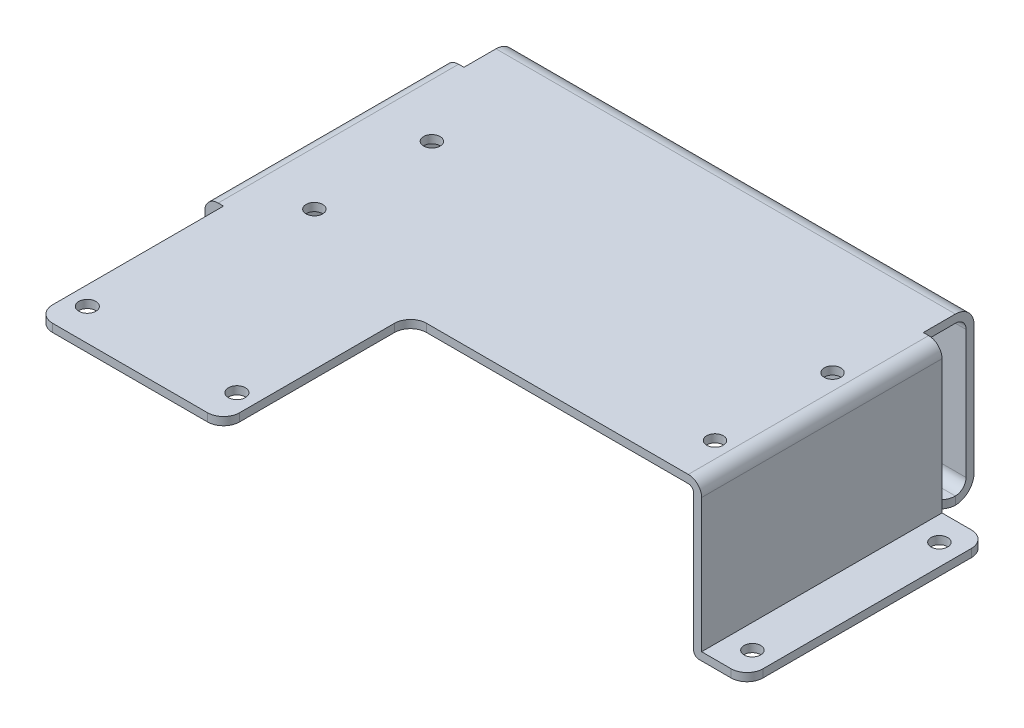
ISO-10303-21;
HEADER;
FILE_DESCRIPTION(('STEP AP214'),'2;1');
FILE_NAME('part.step','',(''),(''),'','','');
FILE_SCHEMA(('AUTOMOTIVE_DESIGN { 1 0 10303 214 1 1 1 1 }'));
ENDSEC;
DATA;
#1=APPLICATION_CONTEXT('core data for automotive mechanical design processes');
#2=APPLICATION_PROTOCOL_DEFINITION('international standard','automotive_design',2000,#1);
#3=PRODUCT_CONTEXT('',#1,'mechanical');
#4=PRODUCT('Part','Part','',(#3));
#5=PRODUCT_RELATED_PRODUCT_CATEGORY('part','',(#4));
#6=PRODUCT_DEFINITION_FORMATION('','',#4);
#7=PRODUCT_DEFINITION_CONTEXT('part definition',#1,'design');
#8=PRODUCT_DEFINITION('design','',#6,#7);
#9=PRODUCT_DEFINITION_SHAPE('','',#8);
#10=(LENGTH_UNIT() NAMED_UNIT(*) SI_UNIT(.MILLI.,.METRE.));
#11=(NAMED_UNIT(*) PLANE_ANGLE_UNIT() SI_UNIT($,.RADIAN.));
#12=(NAMED_UNIT(*) SI_UNIT($,.STERADIAN.) SOLID_ANGLE_UNIT());
#13=UNCERTAINTY_MEASURE_WITH_UNIT(LENGTH_MEASURE(1.E-05),#10,'distance_accuracy_value','');
#14=(GEOMETRIC_REPRESENTATION_CONTEXT(3) GLOBAL_UNCERTAINTY_ASSIGNED_CONTEXT((#13)) GLOBAL_UNIT_ASSIGNED_CONTEXT((#10,
#11,#12)) REPRESENTATION_CONTEXT('',''));
#15=CARTESIAN_POINT('',(0.,0.,0.));
#16=DIRECTION('',(0.,0.,1.));
#17=DIRECTION('',(1.,0.,0.));
#18=AXIS2_PLACEMENT_3D('',#15,#16,#17);
#19=CARTESIAN_POINT('',(-46.,1.,22.5));
#20=DIRECTION('',(0.,0.,-1.));
#21=DIRECTION('',(-1.,0.,0.));
#22=AXIS2_PLACEMENT_3D('',#19,#20,#21);
#23=PLANE('',#22);
#24=DIRECTION('',(-1.,0.,0.));
#25=VECTOR('',#24,1.);
#26=CARTESIAN_POINT('',(-46.,1.5,22.5));
#27=LINE('',#26,#25);
#28=CARTESIAN_POINT('',(-46.5,1.5,22.5));
#29=VERTEX_POINT('',#28);
#30=CARTESIAN_POINT('',(-52.,1.5,22.5));
#31=VERTEX_POINT('',#30);
#32=EDGE_CURVE('E521',#29,#31,#27,.T.);
#33=ORIENTED_EDGE('',*,*,#32,.T.);
#34=DIRECTION('',(0.,1.,0.));
#35=VECTOR('',#34,1.);
#36=CARTESIAN_POINT('',(-52.,0.,22.5));
#37=LINE('',#36,#35);
#38=CARTESIAN_POINT('',(-52.,0.,22.5));
#39=VERTEX_POINT('',#38);
#40=EDGE_CURVE('E375',#31,#39,#37,.F.);
#41=ORIENTED_EDGE('',*,*,#40,.T.);
#42=DIRECTION('',(-1.,0.,0.));
#43=VECTOR('',#42,1.);
#44=CARTESIAN_POINT('',(-46.,0.,22.5));
#45=LINE('',#44,#43);
#46=CARTESIAN_POINT('',(-46.,0.,22.5));
#47=VERTEX_POINT('',#46);
#48=EDGE_CURVE('E524',#47,#39,#45,.T.);
#49=ORIENTED_EDGE('',*,*,#48,.F.);
#50=CARTESIAN_POINT('',(-46.,1.,22.5));
#51=DIRECTION('',(0.,0.,-1.));
#52=DIRECTION('',(-1.,0.,0.));
#53=AXIS2_PLACEMENT_3D('',#50,#51,#52);
#54=CIRCLE('',#53,1.);
#55=CARTESIAN_POINT('',(-45.,1.,22.5));
#56=VERTEX_POINT('',#55);
#57=EDGE_CURVE('E528',#56,#47,#54,.T.);
#58=ORIENTED_EDGE('',*,*,#57,.F.);
#59=DIRECTION('',(0.,-1.,0.));
#60=VECTOR('',#59,1.);
#61=CARTESIAN_POINT('',(-45.,26.5,22.5));
#62=LINE('',#61,#60);
#63=CARTESIAN_POINT('',(-45.,26.5,22.5));
#64=VERTEX_POINT('',#63);
#65=EDGE_CURVE('E531',#64,#56,#62,.T.);
#66=ORIENTED_EDGE('',*,*,#65,.F.);
#67=CARTESIAN_POINT('',(-44.,26.5,22.5));
#68=DIRECTION('',(0.,0.,1.));
#69=DIRECTION('',(1.,0.,0.));
#70=AXIS2_PLACEMENT_3D('',#67,#68,#69);
#71=CIRCLE('',#70,0.999999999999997);
#72=CARTESIAN_POINT('',(-44.,27.5,22.5));
#73=VERTEX_POINT('',#72);
#74=EDGE_CURVE('E534',#73,#64,#71,.T.);
#75=ORIENTED_EDGE('',*,*,#74,.F.);
#76=DIRECTION('',(-1.,0.,0.));
#77=VECTOR('',#76,1.);
#78=CARTESIAN_POINT('',(-44.,27.5,22.5));
#79=LINE('',#78,#77);
#80=CARTESIAN_POINT('',(-43.,27.5,22.5));
#81=VERTEX_POINT('',#80);
#82=EDGE_CURVE('E537',#81,#73,#79,.T.);
#83=ORIENTED_EDGE('',*,*,#82,.F.);
#84=DIRECTION('',(0.,-1.,0.));
#85=VECTOR('',#84,1.);
#86=CARTESIAN_POINT('',(-43.,29.,22.5));
#87=LINE('',#86,#85);
#88=CARTESIAN_POINT('',(-43.,29.,22.5));
#89=VERTEX_POINT('',#88);
#90=EDGE_CURVE('E1290',#89,#81,#87,.T.);
#91=ORIENTED_EDGE('',*,*,#90,.F.);
#92=DIRECTION('',(1.,0.,0.));
#93=VECTOR('',#92,1.);
#94=CARTESIAN_POINT('',(-44.,29.,22.5));
#95=LINE('',#94,#93);
#96=CARTESIAN_POINT('',(-44.,29.,22.5));
#97=VERTEX_POINT('',#96);
#98=EDGE_CURVE('E557',#89,#97,#95,.F.);
#99=ORIENTED_EDGE('',*,*,#98,.T.);
#100=CARTESIAN_POINT('',(-44.,26.5,22.5));
#101=DIRECTION('',(0.,0.,1.));
#102=DIRECTION('',(1.,0.,0.));
#103=AXIS2_PLACEMENT_3D('',#100,#101,#102);
#104=CIRCLE('',#103,2.5);
#105=CARTESIAN_POINT('',(-46.5,26.5,22.5));
#106=VERTEX_POINT('',#105);
#107=EDGE_CURVE('E560',#97,#106,#104,.T.);
#108=ORIENTED_EDGE('',*,*,#107,.T.);
#109=DIRECTION('',(0.,1.,0.));
#110=VECTOR('',#109,1.);
#111=CARTESIAN_POINT('',(-46.5,26.5,22.5));
#112=LINE('',#111,#110);
#113=EDGE_CURVE('E562',#106,#29,#112,.F.);
#114=ORIENTED_EDGE('',*,*,#113,.T.);
#115=EDGE_LOOP('',(#33,#41,#49,#58,#66,#75,#83,#91,#99,#108,#114));
#116=FACE_BOUND('',#115,.T.);
#117=ADVANCED_FACE('F34',(#116),#23,.F.);
#118=CARTESIAN_POINT('',(44.,29.,22.5));
#119=VERTEX_POINT('',#118);
#120=CARTESIAN_POINT('',(-5.00000000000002,29.,22.5));
#121=VERTEX_POINT('',#120);
#122=EDGE_CURVE('E558',#119,#121,#95,.F.);
#123=ORIENTED_EDGE('',*,*,#122,.T.);
#124=DIRECTION('',(0.,1.,0.));
#125=VECTOR('',#124,1.);
#126=CARTESIAN_POINT('',(-5.00000000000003,27.5,22.5));
#127=LINE('',#126,#125);
#128=CARTESIAN_POINT('',(-5.00000000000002,27.5,22.5));
#129=VERTEX_POINT('',#128);
#130=EDGE_CURVE('E49',#121,#129,#127,.F.);
#131=ORIENTED_EDGE('',*,*,#130,.T.);
#132=CARTESIAN_POINT('',(44.,27.5,22.5));
#133=VERTEX_POINT('',#132);
#134=EDGE_CURVE('E538',#133,#129,#79,.T.);
#135=ORIENTED_EDGE('',*,*,#134,.F.);
#136=CARTESIAN_POINT('',(44.,26.5,22.5));
#137=DIRECTION('',(0.,0.,1.));
#138=DIRECTION('',(-1.,0.,0.));
#139=AXIS2_PLACEMENT_3D('',#136,#137,#138);
#140=CIRCLE('',#139,0.999999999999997);
#141=CARTESIAN_POINT('',(45.,26.5,22.5));
#142=VERTEX_POINT('',#141);
#143=EDGE_CURVE('E540',#142,#133,#140,.T.);
#144=ORIENTED_EDGE('',*,*,#143,.F.);
#145=DIRECTION('',(0.,1.,0.));
#146=VECTOR('',#145,1.);
#147=CARTESIAN_POINT('',(45.,26.5,22.5));
#148=LINE('',#147,#146);
#149=CARTESIAN_POINT('',(45.,1.,22.5));
#150=VERTEX_POINT('',#149);
#151=EDGE_CURVE('E543',#150,#142,#148,.T.);
#152=ORIENTED_EDGE('',*,*,#151,.F.);
#153=CARTESIAN_POINT('',(46.,1.,22.5));
#154=DIRECTION('',(0.,0.,-1.));
#155=DIRECTION('',(1.,0.,0.));
#156=AXIS2_PLACEMENT_3D('',#153,#154,#155);
#157=CIRCLE('',#156,1.);
#158=CARTESIAN_POINT('',(46.,0.,22.5));
#159=VERTEX_POINT('',#158);
#160=EDGE_CURVE('E546',#159,#150,#157,.T.);
#161=ORIENTED_EDGE('',*,*,#160,.F.);
#162=DIRECTION('',(-1.,0.,0.));
#163=VECTOR('',#162,1.);
#164=CARTESIAN_POINT('',(46.,0.,22.5));
#165=LINE('',#164,#163);
#166=CARTESIAN_POINT('',(52.,0.,22.5));
#167=VERTEX_POINT('',#166);
#168=EDGE_CURVE('E549',#167,#159,#165,.T.);
#169=ORIENTED_EDGE('',*,*,#168,.F.);
#170=DIRECTION('',(0.,-1.,0.));
#171=VECTOR('',#170,1.);
#172=CARTESIAN_POINT('',(52.,1.5,22.5));
#173=LINE('',#172,#171);
#174=CARTESIAN_POINT('',(52.,1.5,22.5));
#175=VERTEX_POINT('',#174);
#176=EDGE_CURVE('E354',#167,#175,#173,.F.);
#177=ORIENTED_EDGE('',*,*,#176,.T.);
#178=DIRECTION('',(-1.,0.,0.));
#179=VECTOR('',#178,1.);
#180=CARTESIAN_POINT('',(46.,1.5,22.5));
#181=LINE('',#180,#179);
#182=CARTESIAN_POINT('',(46.5,1.5,22.5));
#183=VERTEX_POINT('',#182);
#184=EDGE_CURVE('E551',#175,#183,#181,.T.);
#185=ORIENTED_EDGE('',*,*,#184,.T.);
#186=DIRECTION('',(0.,1.,0.));
#187=VECTOR('',#186,1.);
#188=CARTESIAN_POINT('',(46.5,26.5,22.5));
#189=LINE('',#188,#187);
#190=CARTESIAN_POINT('',(46.5,26.5,22.5));
#191=VERTEX_POINT('',#190);
#192=EDGE_CURVE('E553',#183,#191,#189,.T.);
#193=ORIENTED_EDGE('',*,*,#192,.T.);
#194=CARTESIAN_POINT('',(44.,26.5,22.5));
#195=DIRECTION('',(0.,0.,1.));
#196=DIRECTION('',(1.,0.,0.));
#197=AXIS2_PLACEMENT_3D('',#194,#195,#196);
#198=CIRCLE('',#197,2.5);
#199=EDGE_CURVE('E555',#191,#119,#198,.T.);
#200=ORIENTED_EDGE('',*,*,#199,.T.);
#201=EDGE_LOOP('',(#123,#131,#135,#144,#152,#161,#169,#177,#185,#193,#200));
#202=FACE_BOUND('',#201,.T.);
#203=ADVANCED_FACE('F755',(#202),#23,.F.);
#204=CARTESIAN_POINT('',(-46.,1.,-22.5));
#205=DIRECTION('',(0.,0.,-1.));
#206=DIRECTION('',(-1.,0.,0.));
#207=AXIS2_PLACEMENT_3D('',#204,#205,#206);
#208=PLANE('',#207);
#209=DIRECTION('',(-1.,0.,0.));
#210=VECTOR('',#209,1.);
#211=CARTESIAN_POINT('',(46.,1.5,-22.5));
#212=LINE('',#211,#210);
#213=CARTESIAN_POINT('',(52.,1.5,-22.5));
#214=VERTEX_POINT('',#213);
#215=CARTESIAN_POINT('',(46.5,1.5,-22.5));
#216=VERTEX_POINT('',#215);
#217=EDGE_CURVE('E594',#214,#216,#212,.T.);
#218=ORIENTED_EDGE('',*,*,#217,.F.);
#219=DIRECTION('',(0.,-1.,0.));
#220=VECTOR('',#219,1.);
#221=CARTESIAN_POINT('',(52.,1.,-22.5));
#222=LINE('',#221,#220);
#223=CARTESIAN_POINT('',(52.,0.,-22.5));
#224=VERTEX_POINT('',#223);
#225=EDGE_CURVE('E335',#214,#224,#222,.T.);
#226=ORIENTED_EDGE('',*,*,#225,.T.);
#227=DIRECTION('',(-1.,0.,0.));
#228=VECTOR('',#227,1.);
#229=CARTESIAN_POINT('',(46.,0.,-22.5));
#230=LINE('',#229,#228);
#231=CARTESIAN_POINT('',(46.,0.,-22.5));
#232=VERTEX_POINT('',#231);
#233=EDGE_CURVE('E592',#224,#232,#230,.T.);
#234=ORIENTED_EDGE('',*,*,#233,.T.);
#235=CARTESIAN_POINT('',(46.,1.,-22.5));
#236=DIRECTION('',(0.,0.,-1.));
#237=DIRECTION('',(1.,0.,0.));
#238=AXIS2_PLACEMENT_3D('',#235,#236,#237);
#239=CIRCLE('',#238,1.);
#240=CARTESIAN_POINT('',(45.,1.,-22.5));
#241=VERTEX_POINT('',#240);
#242=EDGE_CURVE('E589',#232,#241,#239,.T.);
#243=ORIENTED_EDGE('',*,*,#242,.T.);
#244=DIRECTION('',(0.,1.,0.));
#245=VECTOR('',#244,1.);
#246=CARTESIAN_POINT('',(45.,26.5,-22.5));
#247=LINE('',#246,#245);
#248=CARTESIAN_POINT('',(45.,26.5,-22.5));
#249=VERTEX_POINT('',#248);
#250=EDGE_CURVE('E586',#241,#249,#247,.T.);
#251=ORIENTED_EDGE('',*,*,#250,.T.);
#252=CARTESIAN_POINT('',(44.,26.5,-22.5));
#253=DIRECTION('',(0.,0.,1.));
#254=DIRECTION('',(-1.,0.,0.));
#255=AXIS2_PLACEMENT_3D('',#252,#253,#254);
#256=CIRCLE('',#255,0.999999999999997);
#257=CARTESIAN_POINT('',(44.,27.5,-22.5));
#258=VERTEX_POINT('',#257);
#259=EDGE_CURVE('E583',#249,#258,#256,.T.);
#260=ORIENTED_EDGE('',*,*,#259,.T.);
#261=DIRECTION('',(-1.,0.,0.));
#262=VECTOR('',#261,1.);
#263=CARTESIAN_POINT('',(-44.,27.5,-22.5));
#264=LINE('',#263,#262);
#265=CARTESIAN_POINT('',(43.,27.5,-22.5));
#266=VERTEX_POINT('',#265);
#267=EDGE_CURVE('E580',#258,#266,#264,.T.);
#268=ORIENTED_EDGE('',*,*,#267,.T.);
#269=DIRECTION('',(0.,1.,0.));
#270=VECTOR('',#269,1.);
#271=CARTESIAN_POINT('',(43.,27.5,-22.5));
#272=LINE('',#271,#270);
#273=CARTESIAN_POINT('',(43.,29.,-22.5));
#274=VERTEX_POINT('',#273);
#275=EDGE_CURVE('E428',#266,#274,#272,.T.);
#276=ORIENTED_EDGE('',*,*,#275,.T.);
#277=DIRECTION('',(1.,0.,0.));
#278=VECTOR('',#277,1.);
#279=CARTESIAN_POINT('',(-44.,29.,-22.5));
#280=LINE('',#279,#278);
#281=CARTESIAN_POINT('',(44.,29.,-22.5));
#282=VERTEX_POINT('',#281);
#283=EDGE_CURVE('E601',#282,#274,#280,.F.);
#284=ORIENTED_EDGE('',*,*,#283,.F.);
#285=CARTESIAN_POINT('',(44.,26.5,-22.5));
#286=DIRECTION('',(0.,0.,1.));
#287=DIRECTION('',(1.,0.,0.));
#288=AXIS2_PLACEMENT_3D('',#285,#286,#287);
#289=CIRCLE('',#288,2.5);
#290=CARTESIAN_POINT('',(46.5,26.5,-22.5));
#291=VERTEX_POINT('',#290);
#292=EDGE_CURVE('E598',#291,#282,#289,.T.);
#293=ORIENTED_EDGE('',*,*,#292,.F.);
#294=DIRECTION('',(0.,1.,0.));
#295=VECTOR('',#294,1.);
#296=CARTESIAN_POINT('',(46.5,26.5,-22.5));
#297=LINE('',#296,#295);
#298=EDGE_CURVE('E596',#216,#291,#297,.T.);
#299=ORIENTED_EDGE('',*,*,#298,.F.);
#300=EDGE_LOOP('',(#218,#226,#234,#243,#251,#260,#268,#276,#284,#293,#299));
#301=FACE_BOUND('',#300,.T.);
#302=ADVANCED_FACE('F715',(#301),#208,.T.);
#303=CARTESIAN_POINT('',(-46.,1.5,22.5));
#304=DIRECTION('',(0.,-1.,0.));
#305=DIRECTION('',(1.,0.,0.));
#306=AXIS2_PLACEMENT_3D('',#303,#304,#305);
#307=PLANE('',#306);
#308=CARTESIAN_POINT('',(-51.,1.5,17.5));
#309=DIRECTION('',(0.,-1.,0.));
#310=DIRECTION('',(1.,0.,0.));
#311=AXIS2_PLACEMENT_3D('',#308,#309,#310);
#312=CIRCLE('',#311,1.55);
#313=CARTESIAN_POINT('',(-52.55,1.5,17.5));
#314=VERTEX_POINT('',#313);
#315=EDGE_CURVE('E511',#314,#314,#312,.T.);
#316=ORIENTED_EDGE('',*,*,#315,.T.);
#317=EDGE_LOOP('',(#316));
#318=FACE_BOUND('',#317,.T.);
#319=CARTESIAN_POINT('',(-51.,1.5,-17.5));
#320=DIRECTION('',(0.,-1.,0.));
#321=DIRECTION('',(1.,0.,0.));
#322=AXIS2_PLACEMENT_3D('',#319,#320,#321);
#323=CIRCLE('',#322,1.55);
#324=CARTESIAN_POINT('',(-52.55,1.5,-17.5));
#325=VERTEX_POINT('',#324);
#326=EDGE_CURVE('E507',#325,#325,#323,.T.);
#327=ORIENTED_EDGE('',*,*,#326,.T.);
#328=EDGE_LOOP('',(#327));
#329=FACE_BOUND('',#328,.T.);
#330=DIRECTION('',(-1.,0.,0.));
#331=VECTOR('',#330,1.);
#332=CARTESIAN_POINT('',(-46.,1.5,-22.5));
#333=LINE('',#332,#331);
#334=CARTESIAN_POINT('',(-46.5,1.5,-22.5));
#335=VERTEX_POINT('',#334);
#336=CARTESIAN_POINT('',(-52.,1.5,-22.5));
#337=VERTEX_POINT('',#336);
#338=EDGE_CURVE('E520',#335,#337,#333,.T.);
#339=ORIENTED_EDGE('',*,*,#338,.T.);
#340=CARTESIAN_POINT('',(-52.,1.5,-19.5));
#341=DIRECTION('',(0.,-1.,0.));
#342=DIRECTION('',(1.,0.,0.));
#343=AXIS2_PLACEMENT_3D('',#340,#341,#342);
#344=CIRCLE('',#343,3.);
#345=CARTESIAN_POINT('',(-55.,1.5,-19.5));
#346=VERTEX_POINT('',#345);
#347=EDGE_CURVE('E364',#337,#346,#344,.F.);
#348=ORIENTED_EDGE('',*,*,#347,.T.);
#349=DIRECTION('',(0.,0.,-1.));
#350=VECTOR('',#349,1.);
#351=CARTESIAN_POINT('',(-55.,1.5,22.5));
#352=LINE('',#351,#350);
#353=CARTESIAN_POINT('',(-55.,1.5,19.5));
#354=VERTEX_POINT('',#353);
#355=EDGE_CURVE('E651',#354,#346,#352,.T.);
#356=ORIENTED_EDGE('',*,*,#355,.F.);
#357=CARTESIAN_POINT('',(-52.,1.5,19.5));
#358=DIRECTION('',(0.,-1.,0.));
#359=DIRECTION('',(1.,0.,0.));
#360=AXIS2_PLACEMENT_3D('',#357,#358,#359);
#361=CIRCLE('',#360,3.);
#362=EDGE_CURVE('E362',#354,#31,#361,.F.);
#363=ORIENTED_EDGE('',*,*,#362,.T.);
#364=ORIENTED_EDGE('',*,*,#32,.F.);
#365=DIRECTION('',(0.,0.,-1.));
#366=VECTOR('',#365,1.);
#367=CARTESIAN_POINT('',(-46.5,1.5,22.5));
#368=LINE('',#367,#366);
#369=EDGE_CURVE('E564',#29,#335,#368,.T.);
#370=ORIENTED_EDGE('',*,*,#369,.T.);
#371=EDGE_LOOP('',(#339,#348,#356,#363,#364,#370));
#372=FACE_BOUND('',#371,.T.);
#373=ADVANCED_FACE('F1134',(#318,#329,#372),#307,.F.);
#374=CARTESIAN_POINT('',(-55.,0.,22.5));
#375=DIRECTION('',(-1.,0.,0.));
#376=DIRECTION('',(0.,0.,1.));
#377=AXIS2_PLACEMENT_3D('',#374,#375,#376);
#378=PLANE('',#377);
#379=ORIENTED_EDGE('',*,*,#355,.T.);
#380=DIRECTION('',(0.,1.,0.));
#381=VECTOR('',#380,1.);
#382=CARTESIAN_POINT('',(-55.,0.,-19.5));
#383=LINE('',#382,#381);
#384=CARTESIAN_POINT('',(-55.,0.,-19.5));
#385=VERTEX_POINT('',#384);
#386=EDGE_CURVE('E369',#346,#385,#383,.F.);
#387=ORIENTED_EDGE('',*,*,#386,.T.);
#388=DIRECTION('',(0.,0.,-1.));
#389=VECTOR('',#388,1.);
#390=CARTESIAN_POINT('',(-55.,0.,22.5));
#391=LINE('',#390,#389);
#392=CARTESIAN_POINT('',(-55.,0.,19.5));
#393=VERTEX_POINT('',#392);
#394=EDGE_CURVE('E648',#393,#385,#391,.T.);
#395=ORIENTED_EDGE('',*,*,#394,.F.);
#396=DIRECTION('',(0.,1.,0.));
#397=VECTOR('',#396,1.);
#398=CARTESIAN_POINT('',(-55.,1.5,19.5));
#399=LINE('',#398,#397);
#400=EDGE_CURVE('E366',#393,#354,#399,.T.);
#401=ORIENTED_EDGE('',*,*,#400,.T.);
#402=EDGE_LOOP('',(#379,#387,#395,#401));
#403=FACE_BOUND('',#402,.T.);
#404=ADVANCED_FACE('F1139',(#403),#378,.T.);
#405=CARTESIAN_POINT('',(-46.,0.,22.5));
#406=DIRECTION('',(0.,-1.,0.));
#407=DIRECTION('',(1.,0.,0.));
#408=AXIS2_PLACEMENT_3D('',#405,#406,#407);
#409=PLANE('',#408);
#410=CARTESIAN_POINT('',(-51.,0.,17.5));
#411=DIRECTION('',(0.,-1.,0.));
#412=DIRECTION('',(1.,0.,0.));
#413=AXIS2_PLACEMENT_3D('',#410,#411,#412);
#414=CIRCLE('',#413,1.55);
#415=CARTESIAN_POINT('',(-52.55,0.,17.5));
#416=VERTEX_POINT('',#415);
#417=EDGE_CURVE('E510',#416,#416,#414,.T.);
#418=ORIENTED_EDGE('',*,*,#417,.F.);
#419=EDGE_LOOP('',(#418));
#420=FACE_BOUND('',#419,.T.);
#421=CARTESIAN_POINT('',(-51.,0.,-17.5));
#422=DIRECTION('',(0.,-1.,0.));
#423=DIRECTION('',(1.,0.,0.));
#424=AXIS2_PLACEMENT_3D('',#421,#422,#423);
#425=CIRCLE('',#424,1.55);
#426=CARTESIAN_POINT('',(-52.55,0.,-17.5));
#427=VERTEX_POINT('',#426);
#428=EDGE_CURVE('E506',#427,#427,#425,.T.);
#429=ORIENTED_EDGE('',*,*,#428,.F.);
#430=EDGE_LOOP('',(#429));
#431=FACE_BOUND('',#430,.T.);
#432=ORIENTED_EDGE('',*,*,#394,.T.);
#433=CARTESIAN_POINT('',(-52.,0.,-19.5));
#434=DIRECTION('',(0.,-1.,0.));
#435=DIRECTION('',(1.,0.,0.));
#436=AXIS2_PLACEMENT_3D('',#433,#434,#435);
#437=CIRCLE('',#436,3.);
#438=CARTESIAN_POINT('',(-52.,0.,-22.5));
#439=VERTEX_POINT('',#438);
#440=EDGE_CURVE('E373',#385,#439,#437,.T.);
#441=ORIENTED_EDGE('',*,*,#440,.T.);
#442=DIRECTION('',(-1.,0.,0.));
#443=VECTOR('',#442,1.);
#444=CARTESIAN_POINT('',(-46.,0.,-22.5));
#445=LINE('',#444,#443);
#446=CARTESIAN_POINT('',(-46.,0.,-22.5));
#447=VERTEX_POINT('',#446);
#448=EDGE_CURVE('E567',#447,#439,#445,.T.);
#449=ORIENTED_EDGE('',*,*,#448,.F.);
#450=DIRECTION('',(0.,0.,-1.));
#451=VECTOR('',#450,1.);
#452=CARTESIAN_POINT('',(-46.,0.,22.5));
#453=LINE('',#452,#451);
#454=EDGE_CURVE('E646',#47,#447,#453,.T.);
#455=ORIENTED_EDGE('',*,*,#454,.F.);
#456=ORIENTED_EDGE('',*,*,#48,.T.);
#457=CARTESIAN_POINT('',(-52.,0.,19.5));
#458=DIRECTION('',(0.,-1.,0.));
#459=DIRECTION('',(1.,0.,0.));
#460=AXIS2_PLACEMENT_3D('',#457,#458,#459);
#461=CIRCLE('',#460,3.);
#462=EDGE_CURVE('E371',#39,#393,#461,.T.);
#463=ORIENTED_EDGE('',*,*,#462,.T.);
#464=EDGE_LOOP('',(#432,#441,#449,#455,#456,#463));
#465=FACE_BOUND('',#464,.T.);
#466=ADVANCED_FACE('F1147',(#420,#431,#465),#409,.T.);
#467=CARTESIAN_POINT('',(-46.,1.,22.5));
#468=DIRECTION('',(0.,0.,-1.));
#469=DIRECTION('',(-1.,0.,0.));
#470=AXIS2_PLACEMENT_3D('',#467,#468,#469);
#471=CYLINDRICAL_SURFACE('',#470,1.);
#472=CARTESIAN_POINT('',(-46.,1.,-22.5));
#473=DIRECTION('',(0.,0.,-1.));
#474=DIRECTION('',(-1.,0.,0.));
#475=AXIS2_PLACEMENT_3D('',#472,#473,#474);
#476=CIRCLE('',#475,1.);
#477=CARTESIAN_POINT('',(-45.,1.,-22.5));
#478=VERTEX_POINT('',#477);
#479=EDGE_CURVE('E570',#478,#447,#476,.T.);
#480=ORIENTED_EDGE('',*,*,#479,.F.);
#481=DIRECTION('',(0.,0.,-1.));
#482=VECTOR('',#481,1.);
#483=CARTESIAN_POINT('',(-45.,1.,22.5));
#484=LINE('',#483,#482);
#485=EDGE_CURVE('E644',#56,#478,#484,.T.);
#486=ORIENTED_EDGE('',*,*,#485,.F.);
#487=ORIENTED_EDGE('',*,*,#57,.T.);
#488=ORIENTED_EDGE('',*,*,#454,.T.);
#489=EDGE_LOOP('',(#480,#486,#487,#488));
#490=FACE_BOUND('',#489,.T.);
#491=ADVANCED_FACE('F1155',(#490),#471,.T.);
#492=CARTESIAN_POINT('',(-45.,26.5,22.5));
#493=DIRECTION('',(1.,0.,0.));
#494=DIRECTION('',(0.,0.,-1.));
#495=AXIS2_PLACEMENT_3D('',#492,#493,#494);
#496=PLANE('',#495);
#497=DIRECTION('',(0.,-1.,0.));
#498=VECTOR('',#497,1.);
#499=CARTESIAN_POINT('',(-45.,26.5,-22.5));
#500=LINE('',#499,#498);
#501=CARTESIAN_POINT('',(-45.,26.5,-22.5));
#502=VERTEX_POINT('',#501);
#503=EDGE_CURVE('E573',#502,#478,#500,.T.);
#504=ORIENTED_EDGE('',*,*,#503,.F.);
#505=DIRECTION('',(0.,0.,-1.));
#506=VECTOR('',#505,1.);
#507=CARTESIAN_POINT('',(-45.,26.5,22.5));
#508=LINE('',#507,#506);
#509=EDGE_CURVE('E642',#64,#502,#508,.T.);
#510=ORIENTED_EDGE('',*,*,#509,.F.);
#511=ORIENTED_EDGE('',*,*,#65,.T.);
#512=ORIENTED_EDGE('',*,*,#485,.T.);
#513=EDGE_LOOP('',(#504,#510,#511,#512));
#514=FACE_BOUND('',#513,.T.);
#515=ADVANCED_FACE('F1164',(#514),#496,.T.);
#516=CARTESIAN_POINT('',(-44.,26.5,22.5));
#517=DIRECTION('',(0.,0.,-1.));
#518=DIRECTION('',(-1.,0.,0.));
#519=AXIS2_PLACEMENT_3D('',#516,#517,#518);
#520=CYLINDRICAL_SURFACE('',#519,0.999999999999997);
#521=CARTESIAN_POINT('',(-44.,26.5,-22.5));
#522=DIRECTION('',(0.,0.,1.));
#523=DIRECTION('',(1.,0.,0.));
#524=AXIS2_PLACEMENT_3D('',#521,#522,#523);
#525=CIRCLE('',#524,0.999999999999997);
#526=CARTESIAN_POINT('',(-44.,27.5,-22.5));
#527=VERTEX_POINT('',#526);
#528=EDGE_CURVE('E576',#527,#502,#525,.T.);
#529=ORIENTED_EDGE('',*,*,#528,.F.);
#530=DIRECTION('',(0.,0.,-1.));
#531=VECTOR('',#530,1.);
#532=CARTESIAN_POINT('',(-44.,27.5,22.5));
#533=LINE('',#532,#531);
#534=EDGE_CURVE('E639',#73,#527,#533,.T.);
#535=ORIENTED_EDGE('',*,*,#534,.F.);
#536=ORIENTED_EDGE('',*,*,#74,.T.);
#537=ORIENTED_EDGE('',*,*,#509,.T.);
#538=EDGE_LOOP('',(#529,#535,#536,#537));
#539=FACE_BOUND('',#538,.T.);
#540=ADVANCED_FACE('F1092',(#539),#520,.F.);
#541=CARTESIAN_POINT('',(-44.,27.5,22.5));
#542=DIRECTION('',(0.,-1.,0.));
#543=DIRECTION('',(0.,0.,-1.));
#544=AXIS2_PLACEMENT_3D('',#541,#542,#543);
#545=PLANE('',#544);
#546=CARTESIAN_POINT('',(-11.5,27.5,51.5));
#547=DIRECTION('',(0.,-1.,0.));
#548=DIRECTION('',(0.,0.,-1.));
#549=AXIS2_PLACEMENT_3D('',#546,#547,#548);
#550=CIRCLE('',#549,1.6);
#551=CARTESIAN_POINT('',(-11.5,27.5,49.9));
#552=VERTEX_POINT('',#551);
#553=EDGE_CURVE('E1304',#552,#552,#550,.T.);
#554=ORIENTED_EDGE('',*,*,#553,.F.);
#555=EDGE_LOOP('',(#554));
#556=FACE_BOUND('',#555,.T.);
#557=CARTESIAN_POINT('',(-39.5,27.5,51.5));
#558=DIRECTION('',(0.,-1.,0.));
#559=DIRECTION('',(0.,0.,-1.));
#560=AXIS2_PLACEMENT_3D('',#557,#558,#559);
#561=CIRCLE('',#560,1.6);
#562=CARTESIAN_POINT('',(-39.5,27.5,49.9));
#563=VERTEX_POINT('',#562);
#564=EDGE_CURVE('E1293',#563,#563,#561,.T.);
#565=ORIENTED_EDGE('',*,*,#564,.F.);
#566=EDGE_LOOP('',(#565));
#567=FACE_BOUND('',#566,.T.);
#568=CARTESIAN_POINT('',(-33.9999999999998,27.5,14.5));
#569=DIRECTION('',(0.,-1.,0.));
#570=DIRECTION('',(0.,0.,-1.));
#571=AXIS2_PLACEMENT_3D('',#568,#569,#570);
#572=CIRCLE('',#571,1.55);
#573=CARTESIAN_POINT('',(-33.9999999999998,27.5,12.95));
#574=VERTEX_POINT('',#573);
#575=EDGE_CURVE('E495',#574,#574,#572,.T.);
#576=ORIENTED_EDGE('',*,*,#575,.F.);
#577=EDGE_LOOP('',(#576));
#578=FACE_BOUND('',#577,.T.);
#579=CARTESIAN_POINT('',(41.0000000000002,27.5,14.5));
#580=DIRECTION('',(0.,-1.,0.));
#581=DIRECTION('',(0.,0.,-1.));
#582=AXIS2_PLACEMENT_3D('',#579,#580,#581);
#583=CIRCLE('',#582,1.55);
#584=CARTESIAN_POINT('',(41.0000000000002,27.5,12.95));
#585=VERTEX_POINT('',#584);
#586=EDGE_CURVE('E492',#585,#585,#583,.T.);
#587=ORIENTED_EDGE('',*,*,#586,.F.);
#588=EDGE_LOOP('',(#587));
#589=FACE_BOUND('',#588,.T.);
#590=CARTESIAN_POINT('',(41.,27.5,-7.5));
#591=DIRECTION('',(0.,-1.,0.));
#592=DIRECTION('',(0.,0.,-1.));
#593=AXIS2_PLACEMENT_3D('',#590,#591,#592);
#594=CIRCLE('',#593,1.55);
#595=CARTESIAN_POINT('',(41.,27.5,-9.05));
#596=VERTEX_POINT('',#595);
#597=EDGE_CURVE('E487',#596,#596,#594,.T.);
#598=ORIENTED_EDGE('',*,*,#597,.F.);
#599=EDGE_LOOP('',(#598));
#600=FACE_BOUND('',#599,.T.);
#601=CARTESIAN_POINT('',(-34.,27.5,-7.5));
#602=DIRECTION('',(0.,-1.,0.));
#603=DIRECTION('',(0.,0.,-1.));
#604=AXIS2_PLACEMENT_3D('',#601,#602,#603);
#605=CIRCLE('',#604,1.55);
#606=CARTESIAN_POINT('',(-34.,27.5,-9.05));
#607=VERTEX_POINT('',#606);
#608=EDGE_CURVE('E517',#607,#607,#605,.T.);
#609=ORIENTED_EDGE('',*,*,#608,.F.);
#610=EDGE_LOOP('',(#609));
#611=FACE_BOUND('',#610,.T.);
#612=DIRECTION('',(0.,0.,-1.));
#613=VECTOR('',#612,1.);
#614=CARTESIAN_POINT('',(-8.00000000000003,27.5,57.5));
#615=LINE('',#614,#613);
#616=CARTESIAN_POINT('',(-8.00000000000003,27.5,54.5));
#617=VERTEX_POINT('',#616);
#618=CARTESIAN_POINT('',(-8.00000000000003,27.5,25.5));
#619=VERTEX_POINT('',#618);
#620=EDGE_CURVE('E406',#617,#619,#615,.T.);
#621=ORIENTED_EDGE('',*,*,#620,.F.);
#622=CARTESIAN_POINT('',(-11.,27.5,54.5));
#623=DIRECTION('',(0.,-1.,0.));
#624=DIRECTION('',(0.,0.,-1.));
#625=AXIS2_PLACEMENT_3D('',#622,#623,#624);
#626=CIRCLE('',#625,3.);
#627=CARTESIAN_POINT('',(-11.,27.5,57.5));
#628=VERTEX_POINT('',#627);
#629=EDGE_CURVE('E391',#617,#628,#626,.T.);
#630=ORIENTED_EDGE('',*,*,#629,.T.);
#631=DIRECTION('',(1.,0.,0.));
#632=VECTOR('',#631,1.);
#633=CARTESIAN_POINT('',(-43.,27.5,57.5));
#634=LINE('',#633,#632);
#635=CARTESIAN_POINT('',(-40.,27.5,57.5));
#636=VERTEX_POINT('',#635);
#637=EDGE_CURVE('E1292',#636,#628,#634,.T.);
#638=ORIENTED_EDGE('',*,*,#637,.F.);
#639=CARTESIAN_POINT('',(-40.,27.5,54.5));
#640=DIRECTION('',(0.,-1.,0.));
#641=DIRECTION('',(0.,0.,-1.));
#642=AXIS2_PLACEMENT_3D('',#639,#640,#641);
#643=CIRCLE('',#642,3.);
#644=CARTESIAN_POINT('',(-43.,27.5,54.5));
#645=VERTEX_POINT('',#644);
#646=EDGE_CURVE('E389',#636,#645,#643,.T.);
#647=ORIENTED_EDGE('',*,*,#646,.T.);
#648=DIRECTION('',(0.,0.,-1.));
#649=VECTOR('',#648,1.);
#650=CARTESIAN_POINT('',(-43.,27.5,57.5));
#651=LINE('',#650,#649);
#652=EDGE_CURVE('E413',#645,#81,#651,.T.);
#653=ORIENTED_EDGE('',*,*,#652,.T.);
#654=ORIENTED_EDGE('',*,*,#82,.T.);
#655=ORIENTED_EDGE('',*,*,#534,.T.);
#656=CARTESIAN_POINT('',(-43.,27.5,-22.5));
#657=VERTEX_POINT('',#656);
#658=EDGE_CURVE('E579',#657,#527,#264,.T.);
#659=ORIENTED_EDGE('',*,*,#658,.F.);
#660=DIRECTION('',(0.,0.,-1.));
#661=VECTOR('',#660,1.);
#662=CARTESIAN_POINT('',(-43.,27.5,-22.5));
#663=LINE('',#662,#661);
#664=CARTESIAN_POINT('',(-43.,27.5,-28.5));
#665=VERTEX_POINT('',#664);
#666=EDGE_CURVE('E452',#657,#665,#663,.T.);
#667=ORIENTED_EDGE('',*,*,#666,.T.);
#668=DIRECTION('',(-1.,0.,0.));
#669=VECTOR('',#668,1.);
#670=CARTESIAN_POINT('',(43.,27.5,-28.5));
#671=LINE('',#670,#669);
#672=CARTESIAN_POINT('',(43.,27.5,-28.5));
#673=VERTEX_POINT('',#672);
#674=EDGE_CURVE('E468',#673,#665,#671,.T.);
#675=ORIENTED_EDGE('',*,*,#674,.F.);
#676=DIRECTION('',(0.,0.,-1.));
#677=VECTOR('',#676,1.);
#678=CARTESIAN_POINT('',(43.,27.5,-22.5));
#679=LINE('',#678,#677);
#680=EDGE_CURVE('E431',#266,#673,#679,.T.);
#681=ORIENTED_EDGE('',*,*,#680,.F.);
#682=ORIENTED_EDGE('',*,*,#267,.F.);
#683=DIRECTION('',(0.,0.,-1.));
#684=VECTOR('',#683,1.);
#685=CARTESIAN_POINT('',(44.,27.5,22.5));
#686=LINE('',#685,#684);
#687=EDGE_CURVE('E637',#133,#258,#686,.T.);
#688=ORIENTED_EDGE('',*,*,#687,.F.);
#689=ORIENTED_EDGE('',*,*,#134,.T.);
#690=CARTESIAN_POINT('',(-5.00000000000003,27.5,25.5));
#691=DIRECTION('',(0.,-1.,0.));
#692=DIRECTION('',(0.,0.,-1.));
#693=AXIS2_PLACEMENT_3D('',#690,#691,#692);
#694=CIRCLE('',#693,3.);
#695=EDGE_CURVE('E11',#129,#619,#694,.F.);
#696=ORIENTED_EDGE('',*,*,#695,.T.);
#697=EDGE_LOOP('',(#621,#630,#638,#647,#653,#654,#655,#659,#667,#675,#681,#682,#688,#689,#696));
#698=FACE_BOUND('',#697,.T.);
#699=ADVANCED_FACE('F694',(#556,#567,#578,#589,#600,#611,#698),#545,.T.);
#700=CARTESIAN_POINT('',(44.,26.5,22.5));
#701=DIRECTION('',(0.,0.,-1.));
#702=DIRECTION('',(-1.,0.,0.));
#703=AXIS2_PLACEMENT_3D('',#700,#701,#702);
#704=CYLINDRICAL_SURFACE('',#703,0.999999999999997);
#705=ORIENTED_EDGE('',*,*,#259,.F.);
#706=DIRECTION('',(0.,0.,-1.));
#707=VECTOR('',#706,1.);
#708=CARTESIAN_POINT('',(45.,26.5,22.5));
#709=LINE('',#708,#707);
#710=EDGE_CURVE('E635',#142,#249,#709,.T.);
#711=ORIENTED_EDGE('',*,*,#710,.F.);
#712=ORIENTED_EDGE('',*,*,#143,.T.);
#713=ORIENTED_EDGE('',*,*,#687,.T.);
#714=EDGE_LOOP('',(#705,#711,#712,#713));
#715=FACE_BOUND('',#714,.T.);
#716=ADVANCED_FACE('F754',(#715),#704,.F.);
#717=CARTESIAN_POINT('',(45.,26.5,22.5));
#718=DIRECTION('',(-1.,0.,0.));
#719=DIRECTION('',(0.,0.,1.));
#720=AXIS2_PLACEMENT_3D('',#717,#718,#719);
#721=PLANE('',#720);
#722=ORIENTED_EDGE('',*,*,#250,.F.);
#723=DIRECTION('',(0.,0.,-1.));
#724=VECTOR('',#723,1.);
#725=CARTESIAN_POINT('',(45.,1.,22.5));
#726=LINE('',#725,#724);
#727=EDGE_CURVE('E633',#150,#241,#726,.T.);
#728=ORIENTED_EDGE('',*,*,#727,.F.);
#729=ORIENTED_EDGE('',*,*,#151,.T.);
#730=ORIENTED_EDGE('',*,*,#710,.T.);
#731=EDGE_LOOP('',(#722,#728,#729,#730));
#732=FACE_BOUND('',#731,.T.);
#733=ADVANCED_FACE('F750',(#732),#721,.T.);
#734=CARTESIAN_POINT('',(46.,1.,22.5));
#735=DIRECTION('',(0.,0.,-1.));
#736=DIRECTION('',(-1.,0.,0.));
#737=AXIS2_PLACEMENT_3D('',#734,#735,#736);
#738=CYLINDRICAL_SURFACE('',#737,1.);
#739=ORIENTED_EDGE('',*,*,#242,.F.);
#740=DIRECTION('',(0.,0.,-1.));
#741=VECTOR('',#740,1.);
#742=CARTESIAN_POINT('',(46.,0.,22.5));
#743=LINE('',#742,#741);
#744=EDGE_CURVE('E630',#159,#232,#743,.T.);
#745=ORIENTED_EDGE('',*,*,#744,.F.);
#746=ORIENTED_EDGE('',*,*,#160,.T.);
#747=ORIENTED_EDGE('',*,*,#727,.T.);
#748=EDGE_LOOP('',(#739,#745,#746,#747));
#749=FACE_BOUND('',#748,.T.);
#750=ADVANCED_FACE('F746',(#749),#738,.T.);
#751=CARTESIAN_POINT('',(46.,0.,22.5));
#752=DIRECTION('',(0.,-1.,0.));
#753=DIRECTION('',(1.,0.,0.));
#754=AXIS2_PLACEMENT_3D('',#751,#752,#753);
#755=PLANE('',#754);
#756=CARTESIAN_POINT('',(51.,0.,-17.5));
#757=DIRECTION('',(0.,-1.,0.));
#758=DIRECTION('',(1.,0.,0.));
#759=AXIS2_PLACEMENT_3D('',#756,#757,#758);
#760=CIRCLE('',#759,1.55);
#761=CARTESIAN_POINT('',(49.45,0.,-17.5));
#762=VERTEX_POINT('',#761);
#763=EDGE_CURVE('E503',#762,#762,#760,.T.);
#764=ORIENTED_EDGE('',*,*,#763,.F.);
#765=EDGE_LOOP('',(#764));
#766=FACE_BOUND('',#765,.T.);
#767=CARTESIAN_POINT('',(51.,0.,17.5));
#768=DIRECTION('',(0.,-1.,0.));
#769=DIRECTION('',(1.,0.,0.));
#770=AXIS2_PLACEMENT_3D('',#767,#768,#769);
#771=CIRCLE('',#770,1.55);
#772=CARTESIAN_POINT('',(49.45,0.,17.5));
#773=VERTEX_POINT('',#772);
#774=EDGE_CURVE('E499',#773,#773,#771,.T.);
#775=ORIENTED_EDGE('',*,*,#774,.F.);
#776=EDGE_LOOP('',(#775));
#777=FACE_BOUND('',#776,.T.);
#778=ORIENTED_EDGE('',*,*,#233,.F.);
#779=CARTESIAN_POINT('',(52.,0.,-19.5));
#780=DIRECTION('',(0.,-1.,0.));
#781=DIRECTION('',(1.,0.,0.));
#782=AXIS2_PLACEMENT_3D('',#779,#780,#781);
#783=CIRCLE('',#782,3.);
#784=CARTESIAN_POINT('',(55.,0.,-19.5));
#785=VERTEX_POINT('',#784);
#786=EDGE_CURVE('E343',#224,#785,#783,.T.);
#787=ORIENTED_EDGE('',*,*,#786,.T.);
#788=DIRECTION('',(0.,0.,-1.));
#789=VECTOR('',#788,1.);
#790=CARTESIAN_POINT('',(55.,0.,22.5));
#791=LINE('',#790,#789);
#792=CARTESIAN_POINT('',(55.,0.,19.5));
#793=VERTEX_POINT('',#792);
#794=EDGE_CURVE('E627',#793,#785,#791,.T.);
#795=ORIENTED_EDGE('',*,*,#794,.F.);
#796=CARTESIAN_POINT('',(52.,0.,19.5));
#797=DIRECTION('',(0.,-1.,0.));
#798=DIRECTION('',(1.,0.,0.));
#799=AXIS2_PLACEMENT_3D('',#796,#797,#798);
#800=CIRCLE('',#799,3.);
#801=EDGE_CURVE('E338',#793,#167,#800,.T.);
#802=ORIENTED_EDGE('',*,*,#801,.T.);
#803=ORIENTED_EDGE('',*,*,#168,.T.);
#804=ORIENTED_EDGE('',*,*,#744,.T.);
#805=EDGE_LOOP('',(#778,#787,#795,#802,#803,#804));
#806=FACE_BOUND('',#805,.T.);
#807=ADVANCED_FACE('F739',(#766,#777,#806),#755,.T.);
#808=CARTESIAN_POINT('',(55.,1.5,22.5));
#809=DIRECTION('',(1.,0.,0.));
#810=DIRECTION('',(0.,0.,-1.));
#811=AXIS2_PLACEMENT_3D('',#808,#809,#810);
#812=PLANE('',#811);
#813=ORIENTED_EDGE('',*,*,#794,.T.);
#814=DIRECTION('',(0.,-1.,0.));
#815=VECTOR('',#814,1.);
#816=CARTESIAN_POINT('',(55.,1.5,-19.5));
#817=LINE('',#816,#815);
#818=CARTESIAN_POINT('',(55.,1.5,-19.5));
#819=VERTEX_POINT('',#818);
#820=EDGE_CURVE('E348',#785,#819,#817,.F.);
#821=ORIENTED_EDGE('',*,*,#820,.T.);
#822=DIRECTION('',(0.,0.,-1.));
#823=VECTOR('',#822,1.);
#824=CARTESIAN_POINT('',(55.,1.5,22.5));
#825=LINE('',#824,#823);
#826=CARTESIAN_POINT('',(55.,1.5,19.5));
#827=VERTEX_POINT('',#826);
#828=EDGE_CURVE('E624',#827,#819,#825,.T.);
#829=ORIENTED_EDGE('',*,*,#828,.F.);
#830=DIRECTION('',(0.,-1.,0.));
#831=VECTOR('',#830,1.);
#832=CARTESIAN_POINT('',(55.,0.,19.5));
#833=LINE('',#832,#831);
#834=EDGE_CURVE('E345',#827,#793,#833,.T.);
#835=ORIENTED_EDGE('',*,*,#834,.T.);
#836=EDGE_LOOP('',(#813,#821,#829,#835));
#837=FACE_BOUND('',#836,.T.);
#838=ADVANCED_FACE('F761',(#837),#812,.T.);
#839=CARTESIAN_POINT('',(46.,1.5,22.5));
#840=DIRECTION('',(0.,-1.,0.));
#841=DIRECTION('',(1.,0.,0.));
#842=AXIS2_PLACEMENT_3D('',#839,#840,#841);
#843=PLANE('',#842);
#844=CARTESIAN_POINT('',(51.,1.5,-17.5));
#845=DIRECTION('',(0.,-1.,0.));
#846=DIRECTION('',(1.,0.,0.));
#847=AXIS2_PLACEMENT_3D('',#844,#845,#846);
#848=CIRCLE('',#847,1.55);
#849=CARTESIAN_POINT('',(49.45,1.5,-17.5));
#850=VERTEX_POINT('',#849);
#851=EDGE_CURVE('E502',#850,#850,#848,.T.);
#852=ORIENTED_EDGE('',*,*,#851,.T.);
#853=EDGE_LOOP('',(#852));
#854=FACE_BOUND('',#853,.T.);
#855=CARTESIAN_POINT('',(51.,1.5,17.5));
#856=DIRECTION('',(0.,-1.,0.));
#857=DIRECTION('',(1.,0.,0.));
#858=AXIS2_PLACEMENT_3D('',#855,#856,#857);
#859=CIRCLE('',#858,1.55);
#860=CARTESIAN_POINT('',(49.45,1.5,17.5));
#861=VERTEX_POINT('',#860);
#862=EDGE_CURVE('E498',#861,#861,#859,.T.);
#863=ORIENTED_EDGE('',*,*,#862,.T.);
#864=EDGE_LOOP('',(#863));
#865=FACE_BOUND('',#864,.T.);
#866=ORIENTED_EDGE('',*,*,#828,.T.);
#867=CARTESIAN_POINT('',(52.,1.5,-19.5));
#868=DIRECTION('',(0.,-1.,0.));
#869=DIRECTION('',(1.,0.,0.));
#870=AXIS2_PLACEMENT_3D('',#867,#868,#869);
#871=CIRCLE('',#870,3.);
#872=EDGE_CURVE('E352',#819,#214,#871,.F.);
#873=ORIENTED_EDGE('',*,*,#872,.T.);
#874=ORIENTED_EDGE('',*,*,#217,.T.);
#875=DIRECTION('',(0.,0.,-1.));
#876=VECTOR('',#875,1.);
#877=CARTESIAN_POINT('',(46.5,1.5,22.5));
#878=LINE('',#877,#876);
#879=EDGE_CURVE('E621',#183,#216,#878,.T.);
#880=ORIENTED_EDGE('',*,*,#879,.F.);
#881=ORIENTED_EDGE('',*,*,#184,.F.);
#882=CARTESIAN_POINT('',(52.,1.5,19.5));
#883=DIRECTION('',(0.,-1.,0.));
#884=DIRECTION('',(1.,0.,0.));
#885=AXIS2_PLACEMENT_3D('',#882,#883,#884);
#886=CIRCLE('',#885,3.);
#887=EDGE_CURVE('E350',#175,#827,#886,.F.);
#888=ORIENTED_EDGE('',*,*,#887,.T.);
#889=EDGE_LOOP('',(#866,#873,#874,#880,#881,#888));
#890=FACE_BOUND('',#889,.T.);
#891=ADVANCED_FACE('F730',(#854,#865,#890),#843,.F.);
#892=CARTESIAN_POINT('',(46.5,26.5,22.5));
#893=DIRECTION('',(-1.,0.,0.));
#894=DIRECTION('',(0.,0.,1.));
#895=AXIS2_PLACEMENT_3D('',#892,#893,#894);
#896=PLANE('',#895);
#897=ORIENTED_EDGE('',*,*,#298,.T.);
#898=DIRECTION('',(0.,0.,-1.));
#899=VECTOR('',#898,1.);
#900=CARTESIAN_POINT('',(46.5,26.5,22.5));
#901=LINE('',#900,#899);
#902=EDGE_CURVE('E618',#191,#291,#901,.T.);
#903=ORIENTED_EDGE('',*,*,#902,.F.);
#904=ORIENTED_EDGE('',*,*,#192,.F.);
#905=ORIENTED_EDGE('',*,*,#879,.T.);
#906=EDGE_LOOP('',(#897,#903,#904,#905));
#907=FACE_BOUND('',#906,.T.);
#908=ADVANCED_FACE('F725',(#907),#896,.F.);
#909=CARTESIAN_POINT('',(44.,26.5,22.5));
#910=DIRECTION('',(0.,0.,-1.));
#911=DIRECTION('',(-1.,0.,0.));
#912=AXIS2_PLACEMENT_3D('',#909,#910,#911);
#913=CYLINDRICAL_SURFACE('',#912,2.5);
#914=ORIENTED_EDGE('',*,*,#292,.T.);
#915=DIRECTION('',(0.,0.,-1.));
#916=VECTOR('',#915,1.);
#917=CARTESIAN_POINT('',(44.,29.,22.5));
#918=LINE('',#917,#916);
#919=EDGE_CURVE('E615',#119,#282,#918,.T.);
#920=ORIENTED_EDGE('',*,*,#919,.F.);
#921=ORIENTED_EDGE('',*,*,#199,.F.);
#922=ORIENTED_EDGE('',*,*,#902,.T.);
#923=EDGE_LOOP('',(#914,#920,#921,#922));
#924=FACE_BOUND('',#923,.T.);
#925=ADVANCED_FACE('F720',(#924),#913,.T.);
#926=CARTESIAN_POINT('',(-44.,29.,22.5));
#927=DIRECTION('',(0.,-1.,0.));
#928=DIRECTION('',(0.,0.,-1.));
#929=AXIS2_PLACEMENT_3D('',#926,#927,#928);
#930=PLANE('',#929);
#931=CARTESIAN_POINT('',(-11.5,29.,51.5));
#932=DIRECTION('',(0.,1.,0.));
#933=DIRECTION('',(0.,0.,1.));
#934=AXIS2_PLACEMENT_3D('',#931,#932,#933);
#935=CIRCLE('',#934,1.6);
#936=CARTESIAN_POINT('',(-11.5,29.,53.1));
#937=VERTEX_POINT('',#936);
#938=EDGE_CURVE('E1307',#937,#937,#935,.T.);
#939=ORIENTED_EDGE('',*,*,#938,.F.);
#940=EDGE_LOOP('',(#939));
#941=FACE_BOUND('',#940,.T.);
#942=CARTESIAN_POINT('',(-39.5,29.,51.5));
#943=DIRECTION('',(0.,1.,0.));
#944=DIRECTION('',(0.,0.,1.));
#945=AXIS2_PLACEMENT_3D('',#942,#943,#944);
#946=CIRCLE('',#945,1.6);
#947=CARTESIAN_POINT('',(-39.5,29.,53.1));
#948=VERTEX_POINT('',#947);
#949=EDGE_CURVE('E1297',#948,#948,#946,.T.);
#950=ORIENTED_EDGE('',*,*,#949,.F.);
#951=EDGE_LOOP('',(#950));
#952=FACE_BOUND('',#951,.T.);
#953=CARTESIAN_POINT('',(-33.9999999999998,29.,14.5));
#954=DIRECTION('',(0.,1.,0.));
#955=DIRECTION('',(-1.,0.,0.));
#956=AXIS2_PLACEMENT_3D('',#953,#954,#955);
#957=CIRCLE('',#956,1.55);
#958=CARTESIAN_POINT('',(-35.5499999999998,29.,14.5));
#959=VERTEX_POINT('',#958);
#960=EDGE_CURVE('E480',#959,#959,#957,.T.);
#961=ORIENTED_EDGE('',*,*,#960,.F.);
#962=EDGE_LOOP('',(#961));
#963=FACE_BOUND('',#962,.T.);
#964=CARTESIAN_POINT('',(41.0000000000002,29.,14.5));
#965=DIRECTION('',(0.,1.,0.));
#966=DIRECTION('',(-1.,0.,0.));
#967=AXIS2_PLACEMENT_3D('',#964,#965,#966);
#968=CIRCLE('',#967,1.55);
#969=CARTESIAN_POINT('',(39.4500000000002,29.,14.5));
#970=VERTEX_POINT('',#969);
#971=EDGE_CURVE('E483',#970,#970,#968,.T.);
#972=ORIENTED_EDGE('',*,*,#971,.F.);
#973=EDGE_LOOP('',(#972));
#974=FACE_BOUND('',#973,.T.);
#975=CARTESIAN_POINT('',(41.,29.,-7.5));
#976=DIRECTION('',(0.,1.,0.));
#977=DIRECTION('',(-1.,0.,0.));
#978=AXIS2_PLACEMENT_3D('',#975,#976,#977);
#979=CIRCLE('',#978,1.55);
#980=CARTESIAN_POINT('',(39.45,29.,-7.5));
#981=VERTEX_POINT('',#980);
#982=EDGE_CURVE('E484',#981,#981,#979,.T.);
#983=ORIENTED_EDGE('',*,*,#982,.F.);
#984=EDGE_LOOP('',(#983));
#985=FACE_BOUND('',#984,.T.);
#986=CARTESIAN_POINT('',(-34.,29.,-7.5));
#987=DIRECTION('',(0.,1.,0.));
#988=DIRECTION('',(-1.,0.,0.));
#989=AXIS2_PLACEMENT_3D('',#986,#987,#988);
#990=CIRCLE('',#989,1.55);
#991=CARTESIAN_POINT('',(-35.55,29.,-7.5));
#992=VERTEX_POINT('',#991);
#993=EDGE_CURVE('E514',#992,#992,#990,.T.);
#994=ORIENTED_EDGE('',*,*,#993,.F.);
#995=EDGE_LOOP('',(#994));
#996=FACE_BOUND('',#995,.T.);
#997=DIRECTION('',(-1.,0.,0.));
#998=VECTOR('',#997,1.);
#999=CARTESIAN_POINT('',(-43.,29.,57.5));
#1000=LINE('',#999,#998);
#1001=CARTESIAN_POINT('',(-11.,29.,57.5));
#1002=VERTEX_POINT('',#1001);
#1003=CARTESIAN_POINT('',(-40.,29.,57.5));
#1004=VERTEX_POINT('',#1003);
#1005=EDGE_CURVE('E415',#1002,#1004,#1000,.T.);
#1006=ORIENTED_EDGE('',*,*,#1005,.F.);
#1007=CARTESIAN_POINT('',(-11.,29.,54.5));
#1008=DIRECTION('',(0.,-1.,0.));
#1009=DIRECTION('',(0.,0.,-1.));
#1010=AXIS2_PLACEMENT_3D('',#1007,#1008,#1009);
#1011=CIRCLE('',#1010,3.);
#1012=CARTESIAN_POINT('',(-8.00000000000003,29.,54.5));
#1013=VERTEX_POINT('',#1012);
#1014=EDGE_CURVE('E385',#1002,#1013,#1011,.F.);
#1015=ORIENTED_EDGE('',*,*,#1014,.T.);
#1016=DIRECTION('',(0.,0.,-1.));
#1017=VECTOR('',#1016,1.);
#1018=CARTESIAN_POINT('',(-8.00000000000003,29.,57.5));
#1019=LINE('',#1018,#1017);
#1020=CARTESIAN_POINT('',(-8.00000000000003,29.,25.5));
#1021=VERTEX_POINT('',#1020);
#1022=EDGE_CURVE('E403',#1013,#1021,#1019,.T.);
#1023=ORIENTED_EDGE('',*,*,#1022,.T.);
#1024=CARTESIAN_POINT('',(-5.00000000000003,29.,25.5));
#1025=DIRECTION('',(0.,-1.,0.));
#1026=DIRECTION('',(0.,0.,-1.));
#1027=AXIS2_PLACEMENT_3D('',#1024,#1025,#1026);
#1028=CIRCLE('',#1027,3.);
#1029=EDGE_CURVE('E42',#1021,#121,#1028,.T.);
#1030=ORIENTED_EDGE('',*,*,#1029,.T.);
#1031=ORIENTED_EDGE('',*,*,#122,.F.);
#1032=ORIENTED_EDGE('',*,*,#919,.T.);
#1033=ORIENTED_EDGE('',*,*,#283,.T.);
#1034=DIRECTION('',(0.,0.,-1.));
#1035=VECTOR('',#1034,1.);
#1036=CARTESIAN_POINT('',(43.,29.,-22.5));
#1037=LINE('',#1036,#1035);
#1038=CARTESIAN_POINT('',(43.,29.,-28.5));
#1039=VERTEX_POINT('',#1038);
#1040=EDGE_CURVE('E425',#274,#1039,#1037,.T.);
#1041=ORIENTED_EDGE('',*,*,#1040,.T.);
#1042=DIRECTION('',(-1.,0.,0.));
#1043=VECTOR('',#1042,1.);
#1044=CARTESIAN_POINT('',(43.,29.,-28.5));
#1045=LINE('',#1044,#1043);
#1046=CARTESIAN_POINT('',(-43.,29.,-28.5));
#1047=VERTEX_POINT('',#1046);
#1048=EDGE_CURVE('E471',#1039,#1047,#1045,.T.);
#1049=ORIENTED_EDGE('',*,*,#1048,.T.);
#1050=DIRECTION('',(0.,0.,-1.));
#1051=VECTOR('',#1050,1.);
#1052=CARTESIAN_POINT('',(-43.,29.,-22.5));
#1053=LINE('',#1052,#1051);
#1054=CARTESIAN_POINT('',(-43.,29.,-22.5));
#1055=VERTEX_POINT('',#1054);
#1056=EDGE_CURVE('E446',#1055,#1047,#1053,.T.);
#1057=ORIENTED_EDGE('',*,*,#1056,.F.);
#1058=CARTESIAN_POINT('',(-44.,29.,-22.5));
#1059=VERTEX_POINT('',#1058);
#1060=EDGE_CURVE('E600',#1055,#1059,#280,.F.);
#1061=ORIENTED_EDGE('',*,*,#1060,.T.);
#1062=DIRECTION('',(0.,0.,-1.));
#1063=VECTOR('',#1062,1.);
#1064=CARTESIAN_POINT('',(-44.,29.,22.5));
#1065=LINE('',#1064,#1063);
#1066=EDGE_CURVE('E612',#97,#1059,#1065,.T.);
#1067=ORIENTED_EDGE('',*,*,#1066,.F.);
#1068=ORIENTED_EDGE('',*,*,#98,.F.);
#1069=DIRECTION('',(0.,0.,-1.));
#1070=VECTOR('',#1069,1.);
#1071=CARTESIAN_POINT('',(-43.,29.,57.5));
#1072=LINE('',#1071,#1070);
#1073=CARTESIAN_POINT('',(-43.,29.,54.5));
#1074=VERTEX_POINT('',#1073);
#1075=EDGE_CURVE('E411',#1074,#89,#1072,.T.);
#1076=ORIENTED_EDGE('',*,*,#1075,.F.);
#1077=CARTESIAN_POINT('',(-40.,29.,54.5));
#1078=DIRECTION('',(0.,-1.,0.));
#1079=DIRECTION('',(0.,0.,-1.));
#1080=AXIS2_PLACEMENT_3D('',#1077,#1078,#1079);
#1081=CIRCLE('',#1080,3.);
#1082=EDGE_CURVE('E383',#1074,#1004,#1081,.F.);
#1083=ORIENTED_EDGE('',*,*,#1082,.T.);
#1084=EDGE_LOOP('',(#1006,#1015,#1023,#1030,#1031,#1032,#1033,#1041,#1049,#1057,#1061,#1067,
#1068,#1076,#1083));
#1085=FACE_BOUND('',#1084,.T.);
#1086=ADVANCED_FACE('F410',(#941,#952,#963,#974,#985,#996,#1085),#930,.F.);
#1087=CARTESIAN_POINT('',(-44.,26.5,22.5));
#1088=DIRECTION('',(0.,0.,-1.));
#1089=DIRECTION('',(-1.,0.,0.));
#1090=AXIS2_PLACEMENT_3D('',#1087,#1088,#1089);
#1091=CYLINDRICAL_SURFACE('',#1090,2.5);
#1092=CARTESIAN_POINT('',(-44.,26.5,-22.5));
#1093=DIRECTION('',(0.,0.,1.));
#1094=DIRECTION('',(1.,0.,0.));
#1095=AXIS2_PLACEMENT_3D('',#1092,#1093,#1094);
#1096=CIRCLE('',#1095,2.5);
#1097=CARTESIAN_POINT('',(-46.5,26.5,-22.5));
#1098=VERTEX_POINT('',#1097);
#1099=EDGE_CURVE('E604',#1059,#1098,#1096,.T.);
#1100=ORIENTED_EDGE('',*,*,#1099,.T.);
#1101=DIRECTION('',(0.,0.,-1.));
#1102=VECTOR('',#1101,1.);
#1103=CARTESIAN_POINT('',(-46.5,26.5,22.5));
#1104=LINE('',#1103,#1102);
#1105=EDGE_CURVE('E609',#106,#1098,#1104,.T.);
#1106=ORIENTED_EDGE('',*,*,#1105,.F.);
#1107=ORIENTED_EDGE('',*,*,#107,.F.);
#1108=ORIENTED_EDGE('',*,*,#1066,.T.);
#1109=EDGE_LOOP('',(#1100,#1106,#1107,#1108));
#1110=FACE_BOUND('',#1109,.T.);
#1111=ADVANCED_FACE('F787',(#1110),#1091,.T.);
#1112=CARTESIAN_POINT('',(-46.5,26.5,22.5));
#1113=DIRECTION('',(1.,0.,0.));
#1114=DIRECTION('',(0.,0.,-1.));
#1115=AXIS2_PLACEMENT_3D('',#1112,#1113,#1114);
#1116=PLANE('',#1115);
#1117=DIRECTION('',(0.,1.,0.));
#1118=VECTOR('',#1117,1.);
#1119=CARTESIAN_POINT('',(-46.5,26.5,-22.5));
#1120=LINE('',#1119,#1118);
#1121=EDGE_CURVE('E525',#1098,#335,#1120,.F.);
#1122=ORIENTED_EDGE('',*,*,#1121,.T.);
#1123=ORIENTED_EDGE('',*,*,#369,.F.);
#1124=ORIENTED_EDGE('',*,*,#113,.F.);
#1125=ORIENTED_EDGE('',*,*,#1105,.T.);
#1126=EDGE_LOOP('',(#1122,#1123,#1124,#1125));
#1127=FACE_BOUND('',#1126,.T.);
#1128=ADVANCED_FACE('F784',(#1127),#1116,.F.);
#1129=ORIENTED_EDGE('',*,*,#448,.T.);
#1130=DIRECTION('',(0.,1.,0.));
#1131=VECTOR('',#1130,1.);
#1132=CARTESIAN_POINT('',(-52.,1.,-22.5));
#1133=LINE('',#1132,#1131);
#1134=EDGE_CURVE('E359',#439,#337,#1133,.T.);
#1135=ORIENTED_EDGE('',*,*,#1134,.T.);
#1136=ORIENTED_EDGE('',*,*,#338,.F.);
#1137=ORIENTED_EDGE('',*,*,#1121,.F.);
#1138=ORIENTED_EDGE('',*,*,#1099,.F.);
#1139=ORIENTED_EDGE('',*,*,#1060,.F.);
#1140=DIRECTION('',(0.,1.,0.));
#1141=VECTOR('',#1140,1.);
#1142=CARTESIAN_POINT('',(-43.,27.5,-22.5));
#1143=LINE('',#1142,#1141);
#1144=EDGE_CURVE('E449',#657,#1055,#1143,.T.);
#1145=ORIENTED_EDGE('',*,*,#1144,.F.);
#1146=ORIENTED_EDGE('',*,*,#658,.T.);
#1147=ORIENTED_EDGE('',*,*,#528,.T.);
#1148=ORIENTED_EDGE('',*,*,#503,.T.);
#1149=ORIENTED_EDGE('',*,*,#479,.T.);
#1150=EDGE_LOOP('',(#1129,#1135,#1136,#1137,#1138,#1139,#1145,#1146,#1147,#1148,#1149));
#1151=FACE_BOUND('',#1150,.T.);
#1152=ADVANCED_FACE('F701',(#1151),#208,.T.);
#1153=CARTESIAN_POINT('',(-34.,-16.,-7.5));
#1154=DIRECTION('',(0.,1.,0.));
#1155=DIRECTION('',(-1.,0.,0.));
#1156=AXIS2_PLACEMENT_3D('',#1153,#1154,#1155);
#1157=CYLINDRICAL_SURFACE('',#1156,1.55);
#1158=ORIENTED_EDGE('',*,*,#608,.T.);
#1159=EDGE_LOOP('',(#1158));
#1160=FACE_BOUND('',#1159,.T.);
#1161=ORIENTED_EDGE('',*,*,#993,.T.);
#1162=EDGE_LOOP('',(#1161));
#1163=FACE_BOUND('',#1162,.T.);
#1164=ADVANCED_FACE('F780',(#1160,#1163),#1157,.F.);
#1165=CARTESIAN_POINT('',(41.,-16.,-7.5));
#1166=DIRECTION('',(0.,1.,0.));
#1167=DIRECTION('',(-1.,0.,0.));
#1168=AXIS2_PLACEMENT_3D('',#1165,#1166,#1167);
#1169=CYLINDRICAL_SURFACE('',#1168,1.55);
#1170=ORIENTED_EDGE('',*,*,#597,.T.);
#1171=EDGE_LOOP('',(#1170));
#1172=FACE_BOUND('',#1171,.T.);
#1173=ORIENTED_EDGE('',*,*,#982,.T.);
#1174=EDGE_LOOP('',(#1173));
#1175=FACE_BOUND('',#1174,.T.);
#1176=ADVANCED_FACE('F832',(#1172,#1175),#1169,.F.);
#1177=CARTESIAN_POINT('',(41.0000000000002,-16.,14.5));
#1178=DIRECTION('',(0.,1.,0.));
#1179=DIRECTION('',(-1.,0.,0.));
#1180=AXIS2_PLACEMENT_3D('',#1177,#1178,#1179);
#1181=CYLINDRICAL_SURFACE('',#1180,1.55);
#1182=ORIENTED_EDGE('',*,*,#586,.T.);
#1183=EDGE_LOOP('',(#1182));
#1184=FACE_BOUND('',#1183,.T.);
#1185=ORIENTED_EDGE('',*,*,#971,.T.);
#1186=EDGE_LOOP('',(#1185));
#1187=FACE_BOUND('',#1186,.T.);
#1188=ADVANCED_FACE('F839',(#1184,#1187),#1181,.F.);
#1189=CARTESIAN_POINT('',(-33.9999999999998,-16.,14.5));
#1190=DIRECTION('',(0.,1.,0.));
#1191=DIRECTION('',(-1.,0.,0.));
#1192=AXIS2_PLACEMENT_3D('',#1189,#1190,#1191);
#1193=CYLINDRICAL_SURFACE('',#1192,1.55);
#1194=ORIENTED_EDGE('',*,*,#575,.T.);
#1195=EDGE_LOOP('',(#1194));
#1196=FACE_BOUND('',#1195,.T.);
#1197=ORIENTED_EDGE('',*,*,#960,.T.);
#1198=EDGE_LOOP('',(#1197));
#1199=FACE_BOUND('',#1198,.T.);
#1200=ADVANCED_FACE('F847',(#1196,#1199),#1193,.F.);
#1201=CARTESIAN_POINT('',(51.,-16.,17.5));
#1202=DIRECTION('',(0.,1.,0.));
#1203=DIRECTION('',(-1.,0.,0.));
#1204=AXIS2_PLACEMENT_3D('',#1201,#1202,#1203);
#1205=CYLINDRICAL_SURFACE('',#1204,1.55);
#1206=CARTESIAN_POINT('',(49.45,0.,17.5));
#1207=CARTESIAN_POINT('',(49.45,0.0156250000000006,17.5));
#1208=CARTESIAN_POINT('',(49.45,0.0312500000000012,17.5));
#1209=CARTESIAN_POINT('',(49.45,0.0625000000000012,17.5));
#1210=CARTESIAN_POINT('',(49.45,0.0781250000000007,17.5));
#1211=CARTESIAN_POINT('',(49.45,0.109375,17.5));
#1212=CARTESIAN_POINT('',(49.45,0.124999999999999,17.5));
#1213=CARTESIAN_POINT('',(49.45,0.156249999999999,17.5));
#1214=CARTESIAN_POINT('',(49.45,0.171875,17.5));
#1215=CARTESIAN_POINT('',(49.45,0.203125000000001,17.5));
#1216=CARTESIAN_POINT('',(49.45,0.218750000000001,17.5));
#1217=CARTESIAN_POINT('',(49.45,0.250000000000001,17.5));
#1218=CARTESIAN_POINT('',(49.45,0.265625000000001,17.5));
#1219=CARTESIAN_POINT('',(49.45,0.296875,17.5));
#1220=CARTESIAN_POINT('',(49.45,0.312499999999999,17.5));
#1221=CARTESIAN_POINT('',(49.45,0.343749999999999,17.5));
#1222=CARTESIAN_POINT('',(49.45,0.359375,17.5));
#1223=CARTESIAN_POINT('',(49.45,0.390625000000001,17.5));
#1224=CARTESIAN_POINT('',(49.45,0.406250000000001,17.5));
#1225=CARTESIAN_POINT('',(49.45,0.437500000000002,17.5));
#1226=CARTESIAN_POINT('',(49.45,0.453125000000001,17.5));
#1227=CARTESIAN_POINT('',(49.45,0.484375,17.5));
#1228=CARTESIAN_POINT('',(49.45,0.499999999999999,17.5));
#1229=CARTESIAN_POINT('',(49.45,0.531249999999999,17.5));
#1230=CARTESIAN_POINT('',(49.45,0.546875,17.5));
#1231=CARTESIAN_POINT('',(49.45,0.578125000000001,17.5));
#1232=CARTESIAN_POINT('',(49.45,0.593750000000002,17.5));
#1233=CARTESIAN_POINT('',(49.45,0.625000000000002,17.5));
#1234=CARTESIAN_POINT('',(49.45,0.640625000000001,17.5));
#1235=CARTESIAN_POINT('',(49.45,0.671875,17.5));
#1236=CARTESIAN_POINT('',(49.45,0.687499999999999,17.5));
#1237=CARTESIAN_POINT('',(49.45,0.718749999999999,17.5));
#1238=CARTESIAN_POINT('',(49.45,0.734375,17.5));
#1239=CARTESIAN_POINT('',(49.45,0.765625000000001,17.5));
#1240=CARTESIAN_POINT('',(49.45,0.781250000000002,17.5));
#1241=CARTESIAN_POINT('',(49.45,0.812500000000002,17.5));
#1242=CARTESIAN_POINT('',(49.45,0.828125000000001,17.5));
#1243=CARTESIAN_POINT('',(49.45,0.859375,17.5));
#1244=CARTESIAN_POINT('',(49.45,0.875,17.5));
#1245=CARTESIAN_POINT('',(49.45,0.90625,17.5));
#1246=CARTESIAN_POINT('',(49.45,0.921875,17.5));
#1247=CARTESIAN_POINT('',(49.45,0.953125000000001,17.5));
#1248=CARTESIAN_POINT('',(49.45,0.968750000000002,17.5));
#1249=CARTESIAN_POINT('',(49.45,1.,17.5));
#1250=CARTESIAN_POINT('',(49.45,1.015625,17.5));
#1251=CARTESIAN_POINT('',(49.45,1.046875,17.5));
#1252=CARTESIAN_POINT('',(49.45,1.0625,17.5));
#1253=CARTESIAN_POINT('',(49.45,1.09375,17.5));
#1254=CARTESIAN_POINT('',(49.45,1.109375,17.5));
#1255=CARTESIAN_POINT('',(49.45,1.140625,17.5));
#1256=CARTESIAN_POINT('',(49.45,1.15625,17.5));
#1257=CARTESIAN_POINT('',(49.45,1.1875,17.5));
#1258=CARTESIAN_POINT('',(49.45,1.203125,17.5));
#1259=CARTESIAN_POINT('',(49.45,1.234375,17.5));
#1260=CARTESIAN_POINT('',(49.45,1.25,17.5));
#1261=CARTESIAN_POINT('',(49.45,1.28125,17.5));
#1262=CARTESIAN_POINT('',(49.45,1.296875,17.5));
#1263=CARTESIAN_POINT('',(49.45,1.328125,17.5));
#1264=CARTESIAN_POINT('',(49.45,1.34375,17.5));
#1265=CARTESIAN_POINT('',(49.45,1.375,17.5));
#1266=CARTESIAN_POINT('',(49.45,1.390625,17.5));
#1267=CARTESIAN_POINT('',(49.45,1.421875,17.5));
#1268=CARTESIAN_POINT('',(49.45,1.4375,17.5));
#1269=CARTESIAN_POINT('',(49.45,1.46875,17.5));
#1270=CARTESIAN_POINT('',(49.45,1.484375,17.5));
#1271=CARTESIAN_POINT('',(49.45,1.5,17.5));
#1272=B_SPLINE_CURVE_WITH_KNOTS('',3,(#1206,#1207,#1208,#1209,#1210,#1211,#1212,#1213,#1214,
#1215,#1216,#1217,#1218,#1219,#1220,#1221,#1222,#1223,#1224,#1225,#1226,#1227,#1228,#1229,#1230,
#1231,#1232,#1233,#1234,#1235,#1236,#1237,#1238,#1239,#1240,#1241,#1242,#1243,#1244,#1245,#1246,
#1247,#1248,#1249,#1250,#1251,#1252,#1253,#1254,#1255,#1256,#1257,#1258,#1259,#1260,#1261,#1262,
#1263,#1264,#1265,#1266,#1267,#1268,#1269,#1270,#1271),.UNSPECIFIED.,.F.,.F.,(4,2,2,2,2,2,2,2,2,
2,2,2,2,2,2,2,2,2,2,2,2,2,2,2,2,2,2,2,2,2,2,2,4),(0.,0.0468750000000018,0.0937500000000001,
0.140624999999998,0.1875,0.234375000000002,0.28125,0.328124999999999,0.375,0.421875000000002,
0.46875,0.515624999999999,0.5625,0.609375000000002,0.656250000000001,0.703124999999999,
0.750000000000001,0.796875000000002,0.843750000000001,0.890624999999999,0.937500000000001,
0.984375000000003,1.03125,1.078125,1.125,1.171875,1.21875,1.265625,1.3125,1.359375,1.40625,
1.453125,1.5),.UNSPECIFIED.);
#1273=EDGE_CURVE('BSEAM854',#773,#861,#1272,.T.);
#1274=ORIENTED_EDGE('',*,*,#774,.T.);
#1275=ORIENTED_EDGE('',*,*,#862,.F.);
#1276=ORIENTED_EDGE('',*,*,#1273,.T.);
#1277=ORIENTED_EDGE('',*,*,#1273,.F.);
#1278=EDGE_LOOP('',(#1274,#1276,#1275,#1277));
#1279=FACE_BOUND('',#1278,.T.);
#1280=ADVANCED_FACE('F854',(#1279),#1205,.F.);
#1281=CARTESIAN_POINT('',(51.,-16.,-17.5));
#1282=DIRECTION('',(0.,1.,0.));
#1283=DIRECTION('',(-1.,0.,0.));
#1284=AXIS2_PLACEMENT_3D('',#1281,#1282,#1283);
#1285=CYLINDRICAL_SURFACE('',#1284,1.55);
#1286=CARTESIAN_POINT('',(49.45,0.,-17.5));
#1287=CARTESIAN_POINT('',(49.45,0.0156250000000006,-17.5));
#1288=CARTESIAN_POINT('',(49.45,0.0312500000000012,-17.5));
#1289=CARTESIAN_POINT('',(49.45,0.0625000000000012,-17.5));
#1290=CARTESIAN_POINT('',(49.45,0.0781250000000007,-17.5));
#1291=CARTESIAN_POINT('',(49.45,0.109375,-17.5));
#1292=CARTESIAN_POINT('',(49.45,0.124999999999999,-17.5));
#1293=CARTESIAN_POINT('',(49.45,0.156249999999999,-17.5));
#1294=CARTESIAN_POINT('',(49.45,0.171875,-17.5));
#1295=CARTESIAN_POINT('',(49.45,0.203125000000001,-17.5));
#1296=CARTESIAN_POINT('',(49.45,0.218750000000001,-17.5));
#1297=CARTESIAN_POINT('',(49.45,0.250000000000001,-17.5));
#1298=CARTESIAN_POINT('',(49.45,0.265625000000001,-17.5));
#1299=CARTESIAN_POINT('',(49.45,0.296875,-17.5));
#1300=CARTESIAN_POINT('',(49.45,0.312499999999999,-17.5));
#1301=CARTESIAN_POINT('',(49.45,0.343749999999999,-17.5));
#1302=CARTESIAN_POINT('',(49.45,0.359375,-17.5));
#1303=CARTESIAN_POINT('',(49.45,0.390625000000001,-17.5));
#1304=CARTESIAN_POINT('',(49.45,0.406250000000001,-17.5));
#1305=CARTESIAN_POINT('',(49.45,0.437500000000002,-17.5));
#1306=CARTESIAN_POINT('',(49.45,0.453125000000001,-17.5));
#1307=CARTESIAN_POINT('',(49.45,0.484375,-17.5));
#1308=CARTESIAN_POINT('',(49.45,0.499999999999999,-17.5));
#1309=CARTESIAN_POINT('',(49.45,0.531249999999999,-17.5));
#1310=CARTESIAN_POINT('',(49.45,0.546875,-17.5));
#1311=CARTESIAN_POINT('',(49.45,0.578125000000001,-17.5));
#1312=CARTESIAN_POINT('',(49.45,0.593750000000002,-17.5));
#1313=CARTESIAN_POINT('',(49.45,0.625000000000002,-17.5));
#1314=CARTESIAN_POINT('',(49.45,0.640625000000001,-17.5));
#1315=CARTESIAN_POINT('',(49.45,0.671875,-17.5));
#1316=CARTESIAN_POINT('',(49.45,0.687499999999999,-17.5));
#1317=CARTESIAN_POINT('',(49.45,0.718749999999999,-17.5));
#1318=CARTESIAN_POINT('',(49.45,0.734375,-17.5));
#1319=CARTESIAN_POINT('',(49.45,0.765625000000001,-17.5));
#1320=CARTESIAN_POINT('',(49.45,0.781250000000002,-17.5));
#1321=CARTESIAN_POINT('',(49.45,0.812500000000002,-17.5));
#1322=CARTESIAN_POINT('',(49.45,0.828125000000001,-17.5));
#1323=CARTESIAN_POINT('',(49.45,0.859375,-17.5));
#1324=CARTESIAN_POINT('',(49.45,0.875,-17.5));
#1325=CARTESIAN_POINT('',(49.45,0.90625,-17.5));
#1326=CARTESIAN_POINT('',(49.45,0.921875,-17.5));
#1327=CARTESIAN_POINT('',(49.45,0.953125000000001,-17.5));
#1328=CARTESIAN_POINT('',(49.45,0.968750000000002,-17.5));
#1329=CARTESIAN_POINT('',(49.45,1.,-17.5));
#1330=CARTESIAN_POINT('',(49.45,1.015625,-17.5));
#1331=CARTESIAN_POINT('',(49.45,1.046875,-17.5));
#1332=CARTESIAN_POINT('',(49.45,1.0625,-17.5));
#1333=CARTESIAN_POINT('',(49.45,1.09375,-17.5));
#1334=CARTESIAN_POINT('',(49.45,1.109375,-17.5));
#1335=CARTESIAN_POINT('',(49.45,1.140625,-17.5));
#1336=CARTESIAN_POINT('',(49.45,1.15625,-17.5));
#1337=CARTESIAN_POINT('',(49.45,1.1875,-17.5));
#1338=CARTESIAN_POINT('',(49.45,1.203125,-17.5));
#1339=CARTESIAN_POINT('',(49.45,1.234375,-17.5));
#1340=CARTESIAN_POINT('',(49.45,1.25,-17.5));
#1341=CARTESIAN_POINT('',(49.45,1.28125,-17.5));
#1342=CARTESIAN_POINT('',(49.45,1.296875,-17.5));
#1343=CARTESIAN_POINT('',(49.45,1.328125,-17.5));
#1344=CARTESIAN_POINT('',(49.45,1.34375,-17.5));
#1345=CARTESIAN_POINT('',(49.45,1.375,-17.5));
#1346=CARTESIAN_POINT('',(49.45,1.390625,-17.5));
#1347=CARTESIAN_POINT('',(49.45,1.421875,-17.5));
#1348=CARTESIAN_POINT('',(49.45,1.4375,-17.5));
#1349=CARTESIAN_POINT('',(49.45,1.46875,-17.5));
#1350=CARTESIAN_POINT('',(49.45,1.484375,-17.5));
#1351=CARTESIAN_POINT('',(49.45,1.5,-17.5));
#1352=B_SPLINE_CURVE_WITH_KNOTS('',3,(#1286,#1287,#1288,#1289,#1290,#1291,#1292,#1293,#1294,
#1295,#1296,#1297,#1298,#1299,#1300,#1301,#1302,#1303,#1304,#1305,#1306,#1307,#1308,#1309,#1310,
#1311,#1312,#1313,#1314,#1315,#1316,#1317,#1318,#1319,#1320,#1321,#1322,#1323,#1324,#1325,#1326,
#1327,#1328,#1329,#1330,#1331,#1332,#1333,#1334,#1335,#1336,#1337,#1338,#1339,#1340,#1341,#1342,
#1343,#1344,#1345,#1346,#1347,#1348,#1349,#1350,#1351),.UNSPECIFIED.,.F.,.F.,(4,2,2,2,2,2,2,2,2,
2,2,2,2,2,2,2,2,2,2,2,2,2,2,2,2,2,2,2,2,2,2,2,4),(0.,0.0468750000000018,0.0937500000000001,
0.140624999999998,0.1875,0.234375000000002,0.28125,0.328124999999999,0.375,0.421875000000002,
0.46875,0.515624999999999,0.5625,0.609375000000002,0.656250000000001,0.703124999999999,
0.750000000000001,0.796875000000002,0.843750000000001,0.890624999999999,0.937500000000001,
0.984375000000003,1.03125,1.078125,1.125,1.171875,1.21875,1.265625,1.3125,1.359375,1.40625,
1.453125,1.5),.UNSPECIFIED.);
#1353=EDGE_CURVE('BSEAM862',#762,#850,#1352,.T.);
#1354=ORIENTED_EDGE('',*,*,#763,.T.);
#1355=ORIENTED_EDGE('',*,*,#851,.F.);
#1356=ORIENTED_EDGE('',*,*,#1353,.T.);
#1357=ORIENTED_EDGE('',*,*,#1353,.F.);
#1358=EDGE_LOOP('',(#1354,#1356,#1355,#1357));
#1359=FACE_BOUND('',#1358,.T.);
#1360=ADVANCED_FACE('F862',(#1359),#1285,.F.);
#1361=CARTESIAN_POINT('',(-51.,-16.,-17.5));
#1362=DIRECTION('',(0.,1.,0.));
#1363=DIRECTION('',(-1.,0.,0.));
#1364=AXIS2_PLACEMENT_3D('',#1361,#1362,#1363);
#1365=CYLINDRICAL_SURFACE('',#1364,1.55);
#1366=CARTESIAN_POINT('',(-52.55,0.,-17.5));
#1367=CARTESIAN_POINT('',(-52.55,0.0156250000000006,-17.5));
#1368=CARTESIAN_POINT('',(-52.55,0.0312500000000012,-17.5));
#1369=CARTESIAN_POINT('',(-52.55,0.0625000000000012,-17.5));
#1370=CARTESIAN_POINT('',(-52.55,0.0781250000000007,-17.5));
#1371=CARTESIAN_POINT('',(-52.55,0.109375,-17.5));
#1372=CARTESIAN_POINT('',(-52.55,0.124999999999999,-17.5));
#1373=CARTESIAN_POINT('',(-52.55,0.156249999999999,-17.5));
#1374=CARTESIAN_POINT('',(-52.55,0.171875,-17.5));
#1375=CARTESIAN_POINT('',(-52.55,0.203125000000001,-17.5));
#1376=CARTESIAN_POINT('',(-52.55,0.218750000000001,-17.5));
#1377=CARTESIAN_POINT('',(-52.55,0.250000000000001,-17.5));
#1378=CARTESIAN_POINT('',(-52.55,0.265625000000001,-17.5));
#1379=CARTESIAN_POINT('',(-52.55,0.296875,-17.5));
#1380=CARTESIAN_POINT('',(-52.55,0.312499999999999,-17.5));
#1381=CARTESIAN_POINT('',(-52.55,0.343749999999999,-17.5));
#1382=CARTESIAN_POINT('',(-52.55,0.359375,-17.5));
#1383=CARTESIAN_POINT('',(-52.55,0.390625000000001,-17.5));
#1384=CARTESIAN_POINT('',(-52.55,0.406250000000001,-17.5));
#1385=CARTESIAN_POINT('',(-52.55,0.437500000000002,-17.5));
#1386=CARTESIAN_POINT('',(-52.55,0.453125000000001,-17.5));
#1387=CARTESIAN_POINT('',(-52.55,0.484375,-17.5));
#1388=CARTESIAN_POINT('',(-52.55,0.499999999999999,-17.5));
#1389=CARTESIAN_POINT('',(-52.55,0.531249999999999,-17.5));
#1390=CARTESIAN_POINT('',(-52.55,0.546875,-17.5));
#1391=CARTESIAN_POINT('',(-52.55,0.578125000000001,-17.5));
#1392=CARTESIAN_POINT('',(-52.55,0.593750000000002,-17.5));
#1393=CARTESIAN_POINT('',(-52.55,0.625000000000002,-17.5));
#1394=CARTESIAN_POINT('',(-52.55,0.640625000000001,-17.5));
#1395=CARTESIAN_POINT('',(-52.55,0.671875,-17.5));
#1396=CARTESIAN_POINT('',(-52.55,0.687499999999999,-17.5));
#1397=CARTESIAN_POINT('',(-52.55,0.718749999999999,-17.5));
#1398=CARTESIAN_POINT('',(-52.55,0.734375,-17.5));
#1399=CARTESIAN_POINT('',(-52.55,0.765625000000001,-17.5));
#1400=CARTESIAN_POINT('',(-52.55,0.781250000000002,-17.5));
#1401=CARTESIAN_POINT('',(-52.55,0.812500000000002,-17.5));
#1402=CARTESIAN_POINT('',(-52.55,0.828125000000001,-17.5));
#1403=CARTESIAN_POINT('',(-52.55,0.859375,-17.5));
#1404=CARTESIAN_POINT('',(-52.55,0.875,-17.5));
#1405=CARTESIAN_POINT('',(-52.55,0.90625,-17.5));
#1406=CARTESIAN_POINT('',(-52.55,0.921875,-17.5));
#1407=CARTESIAN_POINT('',(-52.55,0.953125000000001,-17.5));
#1408=CARTESIAN_POINT('',(-52.55,0.968750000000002,-17.5));
#1409=CARTESIAN_POINT('',(-52.55,1.,-17.5));
#1410=CARTESIAN_POINT('',(-52.55,1.015625,-17.5));
#1411=CARTESIAN_POINT('',(-52.55,1.046875,-17.5));
#1412=CARTESIAN_POINT('',(-52.55,1.0625,-17.5));
#1413=CARTESIAN_POINT('',(-52.55,1.09375,-17.5));
#1414=CARTESIAN_POINT('',(-52.55,1.109375,-17.5));
#1415=CARTESIAN_POINT('',(-52.55,1.140625,-17.5));
#1416=CARTESIAN_POINT('',(-52.55,1.15625,-17.5));
#1417=CARTESIAN_POINT('',(-52.55,1.1875,-17.5));
#1418=CARTESIAN_POINT('',(-52.55,1.203125,-17.5));
#1419=CARTESIAN_POINT('',(-52.55,1.234375,-17.5));
#1420=CARTESIAN_POINT('',(-52.55,1.25,-17.5));
#1421=CARTESIAN_POINT('',(-52.55,1.28125,-17.5));
#1422=CARTESIAN_POINT('',(-52.55,1.296875,-17.5));
#1423=CARTESIAN_POINT('',(-52.55,1.328125,-17.5));
#1424=CARTESIAN_POINT('',(-52.55,1.34375,-17.5));
#1425=CARTESIAN_POINT('',(-52.55,1.375,-17.5));
#1426=CARTESIAN_POINT('',(-52.55,1.390625,-17.5));
#1427=CARTESIAN_POINT('',(-52.55,1.421875,-17.5));
#1428=CARTESIAN_POINT('',(-52.55,1.4375,-17.5));
#1429=CARTESIAN_POINT('',(-52.55,1.46875,-17.5));
#1430=CARTESIAN_POINT('',(-52.55,1.484375,-17.5));
#1431=CARTESIAN_POINT('',(-52.55,1.5,-17.5));
#1432=B_SPLINE_CURVE_WITH_KNOTS('',3,(#1366,#1367,#1368,#1369,#1370,#1371,#1372,#1373,#1374,
#1375,#1376,#1377,#1378,#1379,#1380,#1381,#1382,#1383,#1384,#1385,#1386,#1387,#1388,#1389,#1390,
#1391,#1392,#1393,#1394,#1395,#1396,#1397,#1398,#1399,#1400,#1401,#1402,#1403,#1404,#1405,#1406,
#1407,#1408,#1409,#1410,#1411,#1412,#1413,#1414,#1415,#1416,#1417,#1418,#1419,#1420,#1421,#1422,
#1423,#1424,#1425,#1426,#1427,#1428,#1429,#1430,#1431),.UNSPECIFIED.,.F.,.F.,(4,2,2,2,2,2,2,2,2,
2,2,2,2,2,2,2,2,2,2,2,2,2,2,2,2,2,2,2,2,2,2,2,4),(0.,0.0468750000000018,0.0937500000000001,
0.140624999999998,0.1875,0.234375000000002,0.28125,0.328124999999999,0.375,0.421875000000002,
0.46875,0.515624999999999,0.5625,0.609375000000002,0.656250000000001,0.703124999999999,
0.750000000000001,0.796875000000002,0.843750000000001,0.890624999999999,0.937500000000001,
0.984375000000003,1.03125,1.078125,1.125,1.171875,1.21875,1.265625,1.3125,1.359375,1.40625,
1.453125,1.5),.UNSPECIFIED.);
#1433=EDGE_CURVE('BSEAM870',#427,#325,#1432,.T.);
#1434=ORIENTED_EDGE('',*,*,#428,.T.);
#1435=ORIENTED_EDGE('',*,*,#326,.F.);
#1436=ORIENTED_EDGE('',*,*,#1433,.T.);
#1437=ORIENTED_EDGE('',*,*,#1433,.F.);
#1438=EDGE_LOOP('',(#1434,#1436,#1435,#1437));
#1439=FACE_BOUND('',#1438,.T.);
#1440=ADVANCED_FACE('F870',(#1439),#1365,.F.);
#1441=CARTESIAN_POINT('',(-51.,-16.,17.5));
#1442=DIRECTION('',(0.,1.,0.));
#1443=DIRECTION('',(-1.,0.,0.));
#1444=AXIS2_PLACEMENT_3D('',#1441,#1442,#1443);
#1445=CYLINDRICAL_SURFACE('',#1444,1.55);
#1446=CARTESIAN_POINT('',(-52.55,0.,17.5));
#1447=CARTESIAN_POINT('',(-52.55,0.0156250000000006,17.5));
#1448=CARTESIAN_POINT('',(-52.55,0.0312500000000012,17.5));
#1449=CARTESIAN_POINT('',(-52.55,0.0625000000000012,17.5));
#1450=CARTESIAN_POINT('',(-52.55,0.0781250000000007,17.5));
#1451=CARTESIAN_POINT('',(-52.55,0.109375,17.5));
#1452=CARTESIAN_POINT('',(-52.55,0.124999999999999,17.5));
#1453=CARTESIAN_POINT('',(-52.55,0.156249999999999,17.5));
#1454=CARTESIAN_POINT('',(-52.55,0.171875,17.5));
#1455=CARTESIAN_POINT('',(-52.55,0.203125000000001,17.5));
#1456=CARTESIAN_POINT('',(-52.55,0.218750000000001,17.5));
#1457=CARTESIAN_POINT('',(-52.55,0.250000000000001,17.5));
#1458=CARTESIAN_POINT('',(-52.55,0.265625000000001,17.5));
#1459=CARTESIAN_POINT('',(-52.55,0.296875,17.5));
#1460=CARTESIAN_POINT('',(-52.55,0.312499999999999,17.5));
#1461=CARTESIAN_POINT('',(-52.55,0.343749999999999,17.5));
#1462=CARTESIAN_POINT('',(-52.55,0.359375,17.5));
#1463=CARTESIAN_POINT('',(-52.55,0.390625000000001,17.5));
#1464=CARTESIAN_POINT('',(-52.55,0.406250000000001,17.5));
#1465=CARTESIAN_POINT('',(-52.55,0.437500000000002,17.5));
#1466=CARTESIAN_POINT('',(-52.55,0.453125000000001,17.5));
#1467=CARTESIAN_POINT('',(-52.55,0.484375,17.5));
#1468=CARTESIAN_POINT('',(-52.55,0.499999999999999,17.5));
#1469=CARTESIAN_POINT('',(-52.55,0.531249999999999,17.5));
#1470=CARTESIAN_POINT('',(-52.55,0.546875,17.5));
#1471=CARTESIAN_POINT('',(-52.55,0.578125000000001,17.5));
#1472=CARTESIAN_POINT('',(-52.55,0.593750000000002,17.5));
#1473=CARTESIAN_POINT('',(-52.55,0.625000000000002,17.5));
#1474=CARTESIAN_POINT('',(-52.55,0.640625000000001,17.5));
#1475=CARTESIAN_POINT('',(-52.55,0.671875,17.5));
#1476=CARTESIAN_POINT('',(-52.55,0.687499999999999,17.5));
#1477=CARTESIAN_POINT('',(-52.55,0.718749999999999,17.5));
#1478=CARTESIAN_POINT('',(-52.55,0.734375,17.5));
#1479=CARTESIAN_POINT('',(-52.55,0.765625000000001,17.5));
#1480=CARTESIAN_POINT('',(-52.55,0.781250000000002,17.5));
#1481=CARTESIAN_POINT('',(-52.55,0.812500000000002,17.5));
#1482=CARTESIAN_POINT('',(-52.55,0.828125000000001,17.5));
#1483=CARTESIAN_POINT('',(-52.55,0.859375,17.5));
#1484=CARTESIAN_POINT('',(-52.55,0.875,17.5));
#1485=CARTESIAN_POINT('',(-52.55,0.90625,17.5));
#1486=CARTESIAN_POINT('',(-52.55,0.921875,17.5));
#1487=CARTESIAN_POINT('',(-52.55,0.953125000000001,17.5));
#1488=CARTESIAN_POINT('',(-52.55,0.968750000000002,17.5));
#1489=CARTESIAN_POINT('',(-52.55,1.,17.5));
#1490=CARTESIAN_POINT('',(-52.55,1.015625,17.5));
#1491=CARTESIAN_POINT('',(-52.55,1.046875,17.5));
#1492=CARTESIAN_POINT('',(-52.55,1.0625,17.5));
#1493=CARTESIAN_POINT('',(-52.55,1.09375,17.5));
#1494=CARTESIAN_POINT('',(-52.55,1.109375,17.5));
#1495=CARTESIAN_POINT('',(-52.55,1.140625,17.5));
#1496=CARTESIAN_POINT('',(-52.55,1.15625,17.5));
#1497=CARTESIAN_POINT('',(-52.55,1.1875,17.5));
#1498=CARTESIAN_POINT('',(-52.55,1.203125,17.5));
#1499=CARTESIAN_POINT('',(-52.55,1.234375,17.5));
#1500=CARTESIAN_POINT('',(-52.55,1.25,17.5));
#1501=CARTESIAN_POINT('',(-52.55,1.28125,17.5));
#1502=CARTESIAN_POINT('',(-52.55,1.296875,17.5));
#1503=CARTESIAN_POINT('',(-52.55,1.328125,17.5));
#1504=CARTESIAN_POINT('',(-52.55,1.34375,17.5));
#1505=CARTESIAN_POINT('',(-52.55,1.375,17.5));
#1506=CARTESIAN_POINT('',(-52.55,1.390625,17.5));
#1507=CARTESIAN_POINT('',(-52.55,1.421875,17.5));
#1508=CARTESIAN_POINT('',(-52.55,1.4375,17.5));
#1509=CARTESIAN_POINT('',(-52.55,1.46875,17.5));
#1510=CARTESIAN_POINT('',(-52.55,1.484375,17.5));
#1511=CARTESIAN_POINT('',(-52.55,1.5,17.5));
#1512=B_SPLINE_CURVE_WITH_KNOTS('',3,(#1446,#1447,#1448,#1449,#1450,#1451,#1452,#1453,#1454,
#1455,#1456,#1457,#1458,#1459,#1460,#1461,#1462,#1463,#1464,#1465,#1466,#1467,#1468,#1469,#1470,
#1471,#1472,#1473,#1474,#1475,#1476,#1477,#1478,#1479,#1480,#1481,#1482,#1483,#1484,#1485,#1486,
#1487,#1488,#1489,#1490,#1491,#1492,#1493,#1494,#1495,#1496,#1497,#1498,#1499,#1500,#1501,#1502,
#1503,#1504,#1505,#1506,#1507,#1508,#1509,#1510,#1511),.UNSPECIFIED.,.F.,.F.,(4,2,2,2,2,2,2,2,2,
2,2,2,2,2,2,2,2,2,2,2,2,2,2,2,2,2,2,2,2,2,2,2,4),(0.,0.0468750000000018,0.0937500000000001,
0.140624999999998,0.1875,0.234375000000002,0.28125,0.328124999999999,0.375,0.421875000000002,
0.46875,0.515624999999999,0.5625,0.609375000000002,0.656250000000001,0.703124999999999,
0.750000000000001,0.796875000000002,0.843750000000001,0.890624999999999,0.937500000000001,
0.984375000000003,1.03125,1.078125,1.125,1.171875,1.21875,1.265625,1.3125,1.359375,1.40625,
1.453125,1.5),.UNSPECIFIED.);
#1513=EDGE_CURVE('BSEAM878',#416,#314,#1512,.T.);
#1514=ORIENTED_EDGE('',*,*,#417,.T.);
#1515=ORIENTED_EDGE('',*,*,#315,.F.);
#1516=ORIENTED_EDGE('',*,*,#1513,.T.);
#1517=ORIENTED_EDGE('',*,*,#1513,.F.);
#1518=EDGE_LOOP('',(#1514,#1516,#1515,#1517));
#1519=FACE_BOUND('',#1518,.T.);
#1520=ADVANCED_FACE('F878',(#1519),#1445,.F.);
#1521=CARTESIAN_POINT('',(43.,-0.500000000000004,-28.5));
#1522=DIRECTION('',(0.,-1.,0.));
#1523=DIRECTION('',(0.,0.,-1.));
#1524=AXIS2_PLACEMENT_3D('',#1521,#1522,#1523);
#1525=PLANE('',#1524);
#1526=DIRECTION('',(-1.,0.,0.));
#1527=VECTOR('',#1526,1.);
#1528=CARTESIAN_POINT('',(43.,-0.500000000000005,-25.5));
#1529=LINE('',#1528,#1527);
#1530=CARTESIAN_POINT('',(40.,-0.500000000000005,-25.5));
#1531=VERTEX_POINT('',#1530);
#1532=CARTESIAN_POINT('',(-40.,-0.500000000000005,-25.5));
#1533=VERTEX_POINT('',#1532);
#1534=EDGE_CURVE('E477',#1531,#1533,#1529,.T.);
#1535=ORIENTED_EDGE('',*,*,#1534,.F.);
#1536=CARTESIAN_POINT('',(40.,-0.500000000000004,-28.5));
#1537=DIRECTION('',(0.,-1.,0.));
#1538=DIRECTION('',(0.,0.,-1.));
#1539=AXIS2_PLACEMENT_3D('',#1536,#1537,#1538);
#1540=CIRCLE('',#1539,3.);
#1541=CARTESIAN_POINT('',(43.,-0.500000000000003,-28.5));
#1542=VERTEX_POINT('',#1541);
#1543=EDGE_CURVE('E311',#1531,#1542,#1540,.F.);
#1544=ORIENTED_EDGE('',*,*,#1543,.T.);
#1545=DIRECTION('',(-1.,0.,0.));
#1546=VECTOR('',#1545,1.);
#1547=CARTESIAN_POINT('',(43.,-0.500000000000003,-28.5));
#1548=LINE('',#1547,#1546);
#1549=CARTESIAN_POINT('',(-43.,-0.500000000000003,-28.5));
#1550=VERTEX_POINT('',#1549);
#1551=EDGE_CURVE('E438',#1542,#1550,#1548,.T.);
#1552=ORIENTED_EDGE('',*,*,#1551,.T.);
#1553=CARTESIAN_POINT('',(-40.,-0.500000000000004,-28.5));
#1554=DIRECTION('',(0.,-1.,0.));
#1555=DIRECTION('',(0.,0.,-1.));
#1556=AXIS2_PLACEMENT_3D('',#1553,#1554,#1555);
#1557=CIRCLE('',#1556,3.);
#1558=EDGE_CURVE('E665',#1550,#1533,#1557,.F.);
#1559=ORIENTED_EDGE('',*,*,#1558,.T.);
#1560=EDGE_LOOP('',(#1535,#1544,#1552,#1559));
#1561=FACE_BOUND('',#1560,.T.);
#1562=ADVANCED_FACE('F669',(#1561),#1525,.F.);
#1563=CARTESIAN_POINT('',(43.,-2.,-25.5));
#1564=DIRECTION('',(0.,0.,1.));
#1565=DIRECTION('',(1.,0.,0.));
#1566=AXIS2_PLACEMENT_3D('',#1563,#1564,#1565);
#1567=PLANE('',#1566);
#1568=DIRECTION('',(-1.,0.,0.));
#1569=VECTOR('',#1568,1.);
#1570=CARTESIAN_POINT('',(43.,-2.,-25.5));
#1571=LINE('',#1570,#1569);
#1572=CARTESIAN_POINT('',(40.,-2.,-25.5));
#1573=VERTEX_POINT('',#1572);
#1574=CARTESIAN_POINT('',(-40.,-2.,-25.5));
#1575=VERTEX_POINT('',#1574);
#1576=EDGE_CURVE('E324',#1573,#1575,#1571,.T.);
#1577=ORIENTED_EDGE('',*,*,#1576,.F.);
#1578=DIRECTION('',(0.,1.,0.));
#1579=VECTOR('',#1578,1.);
#1580=CARTESIAN_POINT('',(40.,-2.,-25.5));
#1581=LINE('',#1580,#1579);
#1582=EDGE_CURVE('E334',#1573,#1531,#1581,.T.);
#1583=ORIENTED_EDGE('',*,*,#1582,.T.);
#1584=ORIENTED_EDGE('',*,*,#1534,.T.);
#1585=DIRECTION('',(0.,1.,0.));
#1586=VECTOR('',#1585,1.);
#1587=CARTESIAN_POINT('',(-40.,-2.,-25.5));
#1588=LINE('',#1587,#1586);
#1589=EDGE_CURVE('E654',#1533,#1575,#1588,.F.);
#1590=ORIENTED_EDGE('',*,*,#1589,.T.);
#1591=EDGE_LOOP('',(#1577,#1583,#1584,#1590));
#1592=FACE_BOUND('',#1591,.T.);
#1593=ADVANCED_FACE('F671',(#1592),#1567,.T.);
#1594=CARTESIAN_POINT('',(43.,-2.,-28.5));
#1595=DIRECTION('',(0.,-1.,0.));
#1596=DIRECTION('',(0.,0.,-1.));
#1597=AXIS2_PLACEMENT_3D('',#1594,#1595,#1596);
#1598=PLANE('',#1597);
#1599=DIRECTION('',(-1.,0.,0.));
#1600=VECTOR('',#1599,1.);
#1601=CARTESIAN_POINT('',(43.,-2.,-28.5));
#1602=LINE('',#1601,#1600);
#1603=CARTESIAN_POINT('',(43.,-2.,-28.5));
#1604=VERTEX_POINT('',#1603);
#1605=CARTESIAN_POINT('',(-43.,-2.,-28.5));
#1606=VERTEX_POINT('',#1605);
#1607=EDGE_CURVE('E315',#1604,#1606,#1602,.T.);
#1608=ORIENTED_EDGE('',*,*,#1607,.F.);
#1609=CARTESIAN_POINT('',(40.,-2.,-28.5));
#1610=DIRECTION('',(0.,-1.,0.));
#1611=DIRECTION('',(0.,0.,-1.));
#1612=AXIS2_PLACEMENT_3D('',#1609,#1610,#1611);
#1613=CIRCLE('',#1612,3.);
#1614=EDGE_CURVE('E318',#1604,#1573,#1613,.T.);
#1615=ORIENTED_EDGE('',*,*,#1614,.T.);
#1616=ORIENTED_EDGE('',*,*,#1576,.T.);
#1617=CARTESIAN_POINT('',(-40.,-2.,-28.5));
#1618=DIRECTION('',(0.,-1.,0.));
#1619=DIRECTION('',(0.,0.,-1.));
#1620=AXIS2_PLACEMENT_3D('',#1617,#1618,#1619);
#1621=CIRCLE('',#1620,3.);
#1622=EDGE_CURVE('E310',#1575,#1606,#1621,.T.);
#1623=ORIENTED_EDGE('',*,*,#1622,.T.);
#1624=EDGE_LOOP('',(#1608,#1615,#1616,#1623));
#1625=FACE_BOUND('',#1624,.T.);
#1626=ADVANCED_FACE('F316',(#1625),#1598,.T.);
#1627=CARTESIAN_POINT('',(43.,1.5,-28.5));
#1628=DIRECTION('',(-1.,0.,0.));
#1629=DIRECTION('',(0.,0.,1.));
#1630=AXIS2_PLACEMENT_3D('',#1627,#1628,#1629);
#1631=CYLINDRICAL_SURFACE('',#1630,3.5);
#1632=CARTESIAN_POINT('',(-43.,1.5,-28.5));
#1633=DIRECTION('',(1.,0.,0.));
#1634=DIRECTION('',(0.,0.,-1.));
#1635=AXIS2_PLACEMENT_3D('',#1632,#1633,#1634);
#1636=CIRCLE('',#1635,3.5);
#1637=CARTESIAN_POINT('',(-43.,1.5,-32.));
#1638=VERTEX_POINT('',#1637);
#1639=EDGE_CURVE('E419',#1638,#1606,#1636,.F.);
#1640=ORIENTED_EDGE('',*,*,#1639,.F.);
#1641=DIRECTION('',(-1.,0.,0.));
#1642=VECTOR('',#1641,1.);
#1643=CARTESIAN_POINT('',(43.,1.5,-32.));
#1644=LINE('',#1643,#1642);
#1645=CARTESIAN_POINT('',(43.,1.5,-32.));
#1646=VERTEX_POINT('',#1645);
#1647=EDGE_CURVE('E325',#1646,#1638,#1644,.T.);
#1648=ORIENTED_EDGE('',*,*,#1647,.F.);
#1649=CARTESIAN_POINT('',(43.,1.5,-28.5));
#1650=DIRECTION('',(1.,0.,0.));
#1651=DIRECTION('',(0.,0.,-1.));
#1652=AXIS2_PLACEMENT_3D('',#1649,#1650,#1651);
#1653=CIRCLE('',#1652,3.5);
#1654=EDGE_CURVE('E303',#1646,#1604,#1653,.F.);
#1655=ORIENTED_EDGE('',*,*,#1654,.T.);
#1656=ORIENTED_EDGE('',*,*,#1607,.T.);
#1657=EDGE_LOOP('',(#1640,#1648,#1655,#1656));
#1658=FACE_BOUND('',#1657,.T.);
#1659=ADVANCED_FACE('F327',(#1658),#1631,.T.);
#1660=CARTESIAN_POINT('',(43.,25.5,-32.));
#1661=DIRECTION('',(0.,0.,-1.));
#1662=DIRECTION('',(-1.,0.,0.));
#1663=AXIS2_PLACEMENT_3D('',#1660,#1661,#1662);
#1664=PLANE('',#1663);
#1665=DIRECTION('',(0.,1.,0.));
#1666=VECTOR('',#1665,1.);
#1667=CARTESIAN_POINT('',(-43.,25.5,-32.));
#1668=LINE('',#1667,#1666);
#1669=CARTESIAN_POINT('',(-43.,25.5,-32.));
#1670=VERTEX_POINT('',#1669);
#1671=EDGE_CURVE('E440',#1670,#1638,#1668,.F.);
#1672=ORIENTED_EDGE('',*,*,#1671,.F.);
#1673=DIRECTION('',(-1.,0.,0.));
#1674=VECTOR('',#1673,1.);
#1675=CARTESIAN_POINT('',(43.,25.5,-32.));
#1676=LINE('',#1675,#1674);
#1677=CARTESIAN_POINT('',(43.,25.5,-32.));
#1678=VERTEX_POINT('',#1677);
#1679=EDGE_CURVE('E473',#1678,#1670,#1676,.T.);
#1680=ORIENTED_EDGE('',*,*,#1679,.F.);
#1681=DIRECTION('',(0.,1.,0.));
#1682=VECTOR('',#1681,1.);
#1683=CARTESIAN_POINT('',(43.,25.5,-32.));
#1684=LINE('',#1683,#1682);
#1685=EDGE_CURVE('E328',#1678,#1646,#1684,.F.);
#1686=ORIENTED_EDGE('',*,*,#1685,.T.);
#1687=ORIENTED_EDGE('',*,*,#1647,.T.);
#1688=EDGE_LOOP('',(#1672,#1680,#1686,#1687));
#1689=FACE_BOUND('',#1688,.T.);
#1690=ADVANCED_FACE('F711',(#1689),#1664,.T.);
#1691=CARTESIAN_POINT('',(43.,25.5,-28.5));
#1692=DIRECTION('',(-1.,0.,0.));
#1693=DIRECTION('',(0.,0.,1.));
#1694=AXIS2_PLACEMENT_3D('',#1691,#1692,#1693);
#1695=CYLINDRICAL_SURFACE('',#1694,3.5);
#1696=CARTESIAN_POINT('',(-43.,25.5,-28.5));
#1697=DIRECTION('',(1.,0.,0.));
#1698=DIRECTION('',(0.,0.,-1.));
#1699=AXIS2_PLACEMENT_3D('',#1696,#1697,#1698);
#1700=CIRCLE('',#1699,3.5);
#1701=EDGE_CURVE('E443',#1047,#1670,#1700,.F.);
#1702=ORIENTED_EDGE('',*,*,#1701,.F.);
#1703=ORIENTED_EDGE('',*,*,#1048,.F.);
#1704=CARTESIAN_POINT('',(43.,25.5,-28.5));
#1705=DIRECTION('',(1.,0.,0.));
#1706=DIRECTION('',(0.,0.,-1.));
#1707=AXIS2_PLACEMENT_3D('',#1704,#1705,#1706);
#1708=CIRCLE('',#1707,3.5);
#1709=EDGE_CURVE('E422',#1039,#1678,#1708,.F.);
#1710=ORIENTED_EDGE('',*,*,#1709,.T.);
#1711=ORIENTED_EDGE('',*,*,#1679,.T.);
#1712=EDGE_LOOP('',(#1702,#1703,#1710,#1711));
#1713=FACE_BOUND('',#1712,.T.);
#1714=ADVANCED_FACE('F708',(#1713),#1695,.T.);
#1715=CARTESIAN_POINT('',(43.,25.5,-28.5));
#1716=DIRECTION('',(-1.,0.,0.));
#1717=DIRECTION('',(0.,0.,1.));
#1718=AXIS2_PLACEMENT_3D('',#1715,#1716,#1717);
#1719=CYLINDRICAL_SURFACE('',#1718,2.);
#1720=CARTESIAN_POINT('',(-43.,25.5,-28.5));
#1721=DIRECTION('',(-1.,0.,0.));
#1722=DIRECTION('',(0.,0.,1.));
#1723=AXIS2_PLACEMENT_3D('',#1720,#1721,#1722);
#1724=CIRCLE('',#1723,2.);
#1725=CARTESIAN_POINT('',(-43.,25.5,-30.5));
#1726=VERTEX_POINT('',#1725);
#1727=EDGE_CURVE('E454',#665,#1726,#1724,.T.);
#1728=ORIENTED_EDGE('',*,*,#1727,.T.);
#1729=DIRECTION('',(-1.,0.,0.));
#1730=VECTOR('',#1729,1.);
#1731=CARTESIAN_POINT('',(43.,25.5,-30.5));
#1732=LINE('',#1731,#1730);
#1733=CARTESIAN_POINT('',(43.,25.5,-30.5));
#1734=VERTEX_POINT('',#1733);
#1735=EDGE_CURVE('E465',#1734,#1726,#1732,.T.);
#1736=ORIENTED_EDGE('',*,*,#1735,.F.);
#1737=CARTESIAN_POINT('',(43.,25.5,-28.5));
#1738=DIRECTION('',(-1.,0.,0.));
#1739=DIRECTION('',(0.,0.,1.));
#1740=AXIS2_PLACEMENT_3D('',#1737,#1738,#1739);
#1741=CIRCLE('',#1740,2.);
#1742=EDGE_CURVE('E433',#673,#1734,#1741,.T.);
#1743=ORIENTED_EDGE('',*,*,#1742,.F.);
#1744=ORIENTED_EDGE('',*,*,#674,.T.);
#1745=EDGE_LOOP('',(#1728,#1736,#1743,#1744));
#1746=FACE_BOUND('',#1745,.T.);
#1747=ADVANCED_FACE('F690',(#1746),#1719,.F.);
#1748=CARTESIAN_POINT('',(43.,25.5,-30.5));
#1749=DIRECTION('',(0.,0.,-1.));
#1750=DIRECTION('',(-1.,0.,0.));
#1751=AXIS2_PLACEMENT_3D('',#1748,#1749,#1750);
#1752=PLANE('',#1751);
#1753=DIRECTION('',(0.,-1.,0.));
#1754=VECTOR('',#1753,1.);
#1755=CARTESIAN_POINT('',(-43.,25.5,-30.5));
#1756=LINE('',#1755,#1754);
#1757=CARTESIAN_POINT('',(-43.,1.5,-30.5));
#1758=VERTEX_POINT('',#1757);
#1759=EDGE_CURVE('E456',#1726,#1758,#1756,.T.);
#1760=ORIENTED_EDGE('',*,*,#1759,.T.);
#1761=DIRECTION('',(-1.,0.,0.));
#1762=VECTOR('',#1761,1.);
#1763=CARTESIAN_POINT('',(43.,1.5,-30.5));
#1764=LINE('',#1763,#1762);
#1765=CARTESIAN_POINT('',(43.,1.5,-30.5));
#1766=VERTEX_POINT('',#1765);
#1767=EDGE_CURVE('E462',#1766,#1758,#1764,.T.);
#1768=ORIENTED_EDGE('',*,*,#1767,.F.);
#1769=DIRECTION('',(0.,-1.,0.));
#1770=VECTOR('',#1769,1.);
#1771=CARTESIAN_POINT('',(43.,25.5,-30.5));
#1772=LINE('',#1771,#1770);
#1773=EDGE_CURVE('E435',#1734,#1766,#1772,.T.);
#1774=ORIENTED_EDGE('',*,*,#1773,.F.);
#1775=ORIENTED_EDGE('',*,*,#1735,.T.);
#1776=EDGE_LOOP('',(#1760,#1768,#1774,#1775));
#1777=FACE_BOUND('',#1776,.T.);
#1778=ADVANCED_FACE('F685',(#1777),#1752,.F.);
#1779=CARTESIAN_POINT('',(43.,1.5,-28.5));
#1780=DIRECTION('',(-1.,0.,0.));
#1781=DIRECTION('',(0.,0.,1.));
#1782=AXIS2_PLACEMENT_3D('',#1779,#1780,#1781);
#1783=CYLINDRICAL_SURFACE('',#1782,2.);
#1784=CARTESIAN_POINT('',(-43.,1.5,-28.5));
#1785=DIRECTION('',(-1.,0.,0.));
#1786=DIRECTION('',(0.,0.,1.));
#1787=AXIS2_PLACEMENT_3D('',#1784,#1785,#1786);
#1788=CIRCLE('',#1787,2.);
#1789=EDGE_CURVE('E329',#1758,#1550,#1788,.T.);
#1790=ORIENTED_EDGE('',*,*,#1789,.T.);
#1791=ORIENTED_EDGE('',*,*,#1551,.F.);
#1792=CARTESIAN_POINT('',(43.,1.5,-28.5));
#1793=DIRECTION('',(-1.,0.,0.));
#1794=DIRECTION('',(0.,0.,1.));
#1795=AXIS2_PLACEMENT_3D('',#1792,#1793,#1794);
#1796=CIRCLE('',#1795,2.);
#1797=EDGE_CURVE('E306',#1766,#1542,#1796,.T.);
#1798=ORIENTED_EDGE('',*,*,#1797,.F.);
#1799=ORIENTED_EDGE('',*,*,#1767,.T.);
#1800=EDGE_LOOP('',(#1790,#1791,#1798,#1799));
#1801=FACE_BOUND('',#1800,.T.);
#1802=ADVANCED_FACE('F681',(#1801),#1783,.F.);
#1803=CARTESIAN_POINT('',(43.,1.5,-28.5));
#1804=DIRECTION('',(1.,0.,0.));
#1805=DIRECTION('',(0.,0.,-1.));
#1806=AXIS2_PLACEMENT_3D('',#1803,#1804,#1805);
#1807=PLANE('',#1806);
#1808=ORIENTED_EDGE('',*,*,#1797,.T.);
#1809=DIRECTION('',(0.,1.,0.));
#1810=VECTOR('',#1809,1.);
#1811=CARTESIAN_POINT('',(43.,1.5,-28.5));
#1812=LINE('',#1811,#1810);
#1813=EDGE_CURVE('E298',#1542,#1604,#1812,.F.);
#1814=ORIENTED_EDGE('',*,*,#1813,.T.);
#1815=ORIENTED_EDGE('',*,*,#1654,.F.);
#1816=ORIENTED_EDGE('',*,*,#1685,.F.);
#1817=ORIENTED_EDGE('',*,*,#1709,.F.);
#1818=ORIENTED_EDGE('',*,*,#1040,.F.);
#1819=ORIENTED_EDGE('',*,*,#275,.F.);
#1820=ORIENTED_EDGE('',*,*,#680,.T.);
#1821=ORIENTED_EDGE('',*,*,#1742,.T.);
#1822=ORIENTED_EDGE('',*,*,#1773,.T.);
#1823=EDGE_LOOP('',(#1808,#1814,#1815,#1816,#1817,#1818,#1819,#1820,#1821,#1822));
#1824=FACE_BOUND('',#1823,.T.);
#1825=ADVANCED_FACE('F300',(#1824),#1807,.T.);
#1826=CARTESIAN_POINT('',(-43.,1.5,-28.5));
#1827=DIRECTION('',(1.,0.,0.));
#1828=DIRECTION('',(0.,0.,-1.));
#1829=AXIS2_PLACEMENT_3D('',#1826,#1827,#1828);
#1830=PLANE('',#1829);
#1831=ORIENTED_EDGE('',*,*,#1639,.T.);
#1832=DIRECTION('',(0.,1.,0.));
#1833=VECTOR('',#1832,1.);
#1834=CARTESIAN_POINT('',(-43.,-0.500000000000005,-28.5));
#1835=LINE('',#1834,#1833);
#1836=EDGE_CURVE('E356',#1606,#1550,#1835,.T.);
#1837=ORIENTED_EDGE('',*,*,#1836,.T.);
#1838=ORIENTED_EDGE('',*,*,#1789,.F.);
#1839=ORIENTED_EDGE('',*,*,#1759,.F.);
#1840=ORIENTED_EDGE('',*,*,#1727,.F.);
#1841=ORIENTED_EDGE('',*,*,#666,.F.);
#1842=ORIENTED_EDGE('',*,*,#1144,.T.);
#1843=ORIENTED_EDGE('',*,*,#1056,.T.);
#1844=ORIENTED_EDGE('',*,*,#1701,.T.);
#1845=ORIENTED_EDGE('',*,*,#1671,.T.);
#1846=EDGE_LOOP('',(#1831,#1837,#1838,#1839,#1840,#1841,#1842,#1843,#1844,#1845));
#1847=FACE_BOUND('',#1846,.T.);
#1848=ADVANCED_FACE('F678',(#1847),#1830,.F.);
#1849=CARTESIAN_POINT('',(-43.,29.,57.5));
#1850=DIRECTION('',(1.,0.,0.));
#1851=DIRECTION('',(0.,0.,-1.));
#1852=AXIS2_PLACEMENT_3D('',#1849,#1850,#1851);
#1853=PLANE('',#1852);
#1854=ORIENTED_EDGE('',*,*,#652,.F.);
#1855=DIRECTION('',(0.,-1.,0.));
#1856=VECTOR('',#1855,1.);
#1857=CARTESIAN_POINT('',(-43.,29.,54.5));
#1858=LINE('',#1857,#1856);
#1859=EDGE_CURVE('E393',#645,#1074,#1858,.F.);
#1860=ORIENTED_EDGE('',*,*,#1859,.T.);
#1861=ORIENTED_EDGE('',*,*,#1075,.T.);
#1862=ORIENTED_EDGE('',*,*,#90,.T.);
#1863=EDGE_LOOP('',(#1854,#1860,#1861,#1862));
#1864=FACE_BOUND('',#1863,.T.);
#1865=ADVANCED_FACE('F953',(#1864),#1853,.F.);
#1866=CARTESIAN_POINT('',(-8.00000000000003,29.,57.5));
#1867=DIRECTION('',(-1.,0.,0.));
#1868=DIRECTION('',(0.,0.,1.));
#1869=AXIS2_PLACEMENT_3D('',#1866,#1867,#1868);
#1870=PLANE('',#1869);
#1871=ORIENTED_EDGE('',*,*,#620,.T.);
#1872=DIRECTION('',(0.,1.,0.));
#1873=VECTOR('',#1872,1.);
#1874=CARTESIAN_POINT('',(-8.00000000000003,29.,25.5));
#1875=LINE('',#1874,#1873);
#1876=EDGE_CURVE('E395',#619,#1021,#1875,.T.);
#1877=ORIENTED_EDGE('',*,*,#1876,.T.);
#1878=ORIENTED_EDGE('',*,*,#1022,.F.);
#1879=DIRECTION('',(0.,1.,0.));
#1880=VECTOR('',#1879,1.);
#1881=CARTESIAN_POINT('',(-8.00000000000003,27.5,54.5));
#1882=LINE('',#1881,#1880);
#1883=EDGE_CURVE('E387',#1013,#617,#1882,.F.);
#1884=ORIENTED_EDGE('',*,*,#1883,.T.);
#1885=EDGE_LOOP('',(#1871,#1877,#1878,#1884));
#1886=FACE_BOUND('',#1885,.T.);
#1887=ADVANCED_FACE('F402',(#1886),#1870,.F.);
#1888=CARTESIAN_POINT('',(0.,0.,57.5));
#1889=DIRECTION('',(0.,0.,1.));
#1890=DIRECTION('',(1.,0.,0.));
#1891=AXIS2_PLACEMENT_3D('',#1888,#1889,#1890);
#1892=PLANE('',#1891);
#1893=ORIENTED_EDGE('',*,*,#637,.T.);
#1894=DIRECTION('',(0.,1.,0.));
#1895=VECTOR('',#1894,1.);
#1896=CARTESIAN_POINT('',(-11.,29.,57.5));
#1897=LINE('',#1896,#1895);
#1898=EDGE_CURVE('E380',#628,#1002,#1897,.T.);
#1899=ORIENTED_EDGE('',*,*,#1898,.T.);
#1900=ORIENTED_EDGE('',*,*,#1005,.T.);
#1901=DIRECTION('',(0.,-1.,0.));
#1902=VECTOR('',#1901,1.);
#1903=CARTESIAN_POINT('',(-40.,27.5,57.5));
#1904=LINE('',#1903,#1902);
#1905=EDGE_CURVE('E377',#1004,#636,#1904,.T.);
#1906=ORIENTED_EDGE('',*,*,#1905,.T.);
#1907=EDGE_LOOP('',(#1893,#1899,#1900,#1906));
#1908=FACE_BOUND('',#1907,.T.);
#1909=ADVANCED_FACE('F967',(#1908),#1892,.T.);
#1910=CARTESIAN_POINT('',(-39.5,14.,51.5));
#1911=DIRECTION('',(0.,1.,0.));
#1912=DIRECTION('',(0.,0.,1.));
#1913=AXIS2_PLACEMENT_3D('',#1910,#1911,#1912);
#1914=CYLINDRICAL_SURFACE('',#1913,1.6);
#1915=ORIENTED_EDGE('',*,*,#564,.T.);
#1916=EDGE_LOOP('',(#1915));
#1917=FACE_BOUND('',#1916,.T.);
#1918=ORIENTED_EDGE('',*,*,#949,.T.);
#1919=EDGE_LOOP('',(#1918));
#1920=FACE_BOUND('',#1919,.T.);
#1921=ADVANCED_FACE('F974',(#1917,#1920),#1914,.F.);
#1922=CARTESIAN_POINT('',(-11.5,14.,51.5));
#1923=DIRECTION('',(0.,1.,0.));
#1924=DIRECTION('',(0.,0.,1.));
#1925=AXIS2_PLACEMENT_3D('',#1922,#1923,#1924);
#1926=CYLINDRICAL_SURFACE('',#1925,1.6);
#1927=ORIENTED_EDGE('',*,*,#553,.T.);
#1928=EDGE_LOOP('',(#1927));
#1929=FACE_BOUND('',#1928,.T.);
#1930=ORIENTED_EDGE('',*,*,#938,.T.);
#1931=EDGE_LOOP('',(#1930));
#1932=FACE_BOUND('',#1931,.T.);
#1933=ADVANCED_FACE('F982',(#1929,#1932),#1926,.F.);
#1934=CARTESIAN_POINT('',(40.,-2.,-28.5));
#1935=DIRECTION('',(0.,1.,0.));
#1936=DIRECTION('',(0.,0.,1.));
#1937=AXIS2_PLACEMENT_3D('',#1934,#1935,#1936);
#1938=CYLINDRICAL_SURFACE('',#1937,3.);
#1939=ORIENTED_EDGE('',*,*,#1614,.F.);
#1940=ORIENTED_EDGE('',*,*,#1813,.F.);
#1941=ORIENTED_EDGE('',*,*,#1543,.F.);
#1942=ORIENTED_EDGE('',*,*,#1582,.F.);
#1943=EDGE_LOOP('',(#1939,#1940,#1941,#1942));
#1944=FACE_BOUND('',#1943,.T.);
#1945=ADVANCED_FACE('F332',(#1944),#1938,.T.);
#1946=CARTESIAN_POINT('',(52.,1.,-19.5));
#1947=DIRECTION('',(0.,-1.,0.));
#1948=DIRECTION('',(0.,0.,-1.));
#1949=AXIS2_PLACEMENT_3D('',#1946,#1947,#1948);
#1950=CYLINDRICAL_SURFACE('',#1949,3.);
#1951=ORIENTED_EDGE('',*,*,#872,.F.);
#1952=ORIENTED_EDGE('',*,*,#820,.F.);
#1953=ORIENTED_EDGE('',*,*,#786,.F.);
#1954=ORIENTED_EDGE('',*,*,#225,.F.);
#1955=EDGE_LOOP('',(#1951,#1952,#1953,#1954));
#1956=FACE_BOUND('',#1955,.T.);
#1957=ADVANCED_FACE('F736',(#1956),#1950,.T.);
#1958=CARTESIAN_POINT('',(52.,1.5,19.5));
#1959=DIRECTION('',(0.,1.,0.));
#1960=DIRECTION('',(0.,0.,1.));
#1961=AXIS2_PLACEMENT_3D('',#1958,#1959,#1960);
#1962=CYLINDRICAL_SURFACE('',#1961,3.);
#1963=ORIENTED_EDGE('',*,*,#887,.F.);
#1964=ORIENTED_EDGE('',*,*,#176,.F.);
#1965=ORIENTED_EDGE('',*,*,#801,.F.);
#1966=ORIENTED_EDGE('',*,*,#834,.F.);
#1967=EDGE_LOOP('',(#1963,#1964,#1965,#1966));
#1968=FACE_BOUND('',#1967,.T.);
#1969=ADVANCED_FACE('F758',(#1968),#1962,.T.);
#1970=CARTESIAN_POINT('',(-40.,1.5,-28.5));
#1971=DIRECTION('',(0.,-1.,0.));
#1972=DIRECTION('',(0.,0.,-1.));
#1973=AXIS2_PLACEMENT_3D('',#1970,#1971,#1972);
#1974=CYLINDRICAL_SURFACE('',#1973,3.);
#1975=ORIENTED_EDGE('',*,*,#1622,.F.);
#1976=ORIENTED_EDGE('',*,*,#1589,.F.);
#1977=ORIENTED_EDGE('',*,*,#1558,.F.);
#1978=ORIENTED_EDGE('',*,*,#1836,.F.);
#1979=EDGE_LOOP('',(#1975,#1976,#1977,#1978));
#1980=FACE_BOUND('',#1979,.T.);
#1981=ADVANCED_FACE('F675',(#1980),#1974,.T.);
#1982=CARTESIAN_POINT('',(-52.,1.,-19.5));
#1983=DIRECTION('',(0.,1.,0.));
#1984=DIRECTION('',(0.,0.,1.));
#1985=AXIS2_PLACEMENT_3D('',#1982,#1983,#1984);
#1986=CYLINDRICAL_SURFACE('',#1985,3.);
#1987=ORIENTED_EDGE('',*,*,#440,.F.);
#1988=ORIENTED_EDGE('',*,*,#386,.F.);
#1989=ORIENTED_EDGE('',*,*,#347,.F.);
#1990=ORIENTED_EDGE('',*,*,#1134,.F.);
#1991=EDGE_LOOP('',(#1987,#1988,#1989,#1990));
#1992=FACE_BOUND('',#1991,.T.);
#1993=ADVANCED_FACE('F1014',(#1992),#1986,.T.);
#1994=CARTESIAN_POINT('',(-52.,0.,19.5));
#1995=DIRECTION('',(0.,-1.,0.));
#1996=DIRECTION('',(0.,0.,-1.));
#1997=AXIS2_PLACEMENT_3D('',#1994,#1995,#1996);
#1998=CYLINDRICAL_SURFACE('',#1997,3.);
#1999=ORIENTED_EDGE('',*,*,#462,.F.);
#2000=ORIENTED_EDGE('',*,*,#40,.F.);
#2001=ORIENTED_EDGE('',*,*,#362,.F.);
#2002=ORIENTED_EDGE('',*,*,#400,.F.);
#2003=EDGE_LOOP('',(#1999,#2000,#2001,#2002));
#2004=FACE_BOUND('',#2003,.T.);
#2005=ADVANCED_FACE('F1021',(#2004),#1998,.T.);
#2006=CARTESIAN_POINT('',(-11.,0.,54.5));
#2007=DIRECTION('',(0.,-1.,0.));
#2008=DIRECTION('',(0.,0.,-1.));
#2009=AXIS2_PLACEMENT_3D('',#2006,#2007,#2008);
#2010=CYLINDRICAL_SURFACE('',#2009,3.);
#2011=ORIENTED_EDGE('',*,*,#629,.F.);
#2012=ORIENTED_EDGE('',*,*,#1883,.F.);
#2013=ORIENTED_EDGE('',*,*,#1014,.F.);
#2014=ORIENTED_EDGE('',*,*,#1898,.F.);
#2015=EDGE_LOOP('',(#2011,#2012,#2013,#2014));
#2016=FACE_BOUND('',#2015,.T.);
#2017=ADVANCED_FACE('F1029',(#2016),#2010,.T.);
#2018=CARTESIAN_POINT('',(-40.,0.,54.5));
#2019=DIRECTION('',(0.,1.,0.));
#2020=DIRECTION('',(0.,0.,1.));
#2021=AXIS2_PLACEMENT_3D('',#2018,#2019,#2020);
#2022=CYLINDRICAL_SURFACE('',#2021,3.);
#2023=ORIENTED_EDGE('',*,*,#1082,.F.);
#2024=ORIENTED_EDGE('',*,*,#1859,.F.);
#2025=ORIENTED_EDGE('',*,*,#646,.F.);
#2026=ORIENTED_EDGE('',*,*,#1905,.F.);
#2027=EDGE_LOOP('',(#2023,#2024,#2025,#2026));
#2028=FACE_BOUND('',#2027,.T.);
#2029=ADVANCED_FACE('F1037',(#2028),#2022,.T.);
#2030=CARTESIAN_POINT('',(-5.00000000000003,29.,25.5));
#2031=DIRECTION('',(0.,-1.,0.));
#2032=DIRECTION('',(0.,0.,-1.));
#2033=AXIS2_PLACEMENT_3D('',#2030,#2031,#2032);
#2034=CYLINDRICAL_SURFACE('',#2033,3.);
#2035=ORIENTED_EDGE('',*,*,#695,.F.);
#2036=ORIENTED_EDGE('',*,*,#130,.F.);
#2037=ORIENTED_EDGE('',*,*,#1029,.F.);
#2038=ORIENTED_EDGE('',*,*,#1876,.F.);
#2039=EDGE_LOOP('',(#2035,#2036,#2037,#2038));
#2040=FACE_BOUND('',#2039,.T.);
#2041=ADVANCED_FACE('F36',(#2040),#2034,.F.);
#2042=CLOSED_SHELL('',(#117,#203,#302,#373,#404,#466,#491,#515,#540,#699,#716,#733,#750,#807,
#838,#891,#908,#925,#1086,#1111,#1128,#1152,#1164,#1176,#1188,#1200,#1280,#1360,#1440,#1520,
#1562,#1593,#1626,#1659,#1690,#1714,#1747,#1778,#1802,#1825,#1848,#1865,#1887,#1909,#1921,#1933,
#1945,#1957,#1969,#1981,#1993,#2005,#2017,#2029,#2041));
#2043=MANIFOLD_SOLID_BREP('B2',#2042);
#2044=ADVANCED_BREP_SHAPE_REPRESENTATION('',(#18,#2043),#14);
#2045=SHAPE_DEFINITION_REPRESENTATION(#9,#2044);
ENDSEC;
END-ISO-10303-21;
